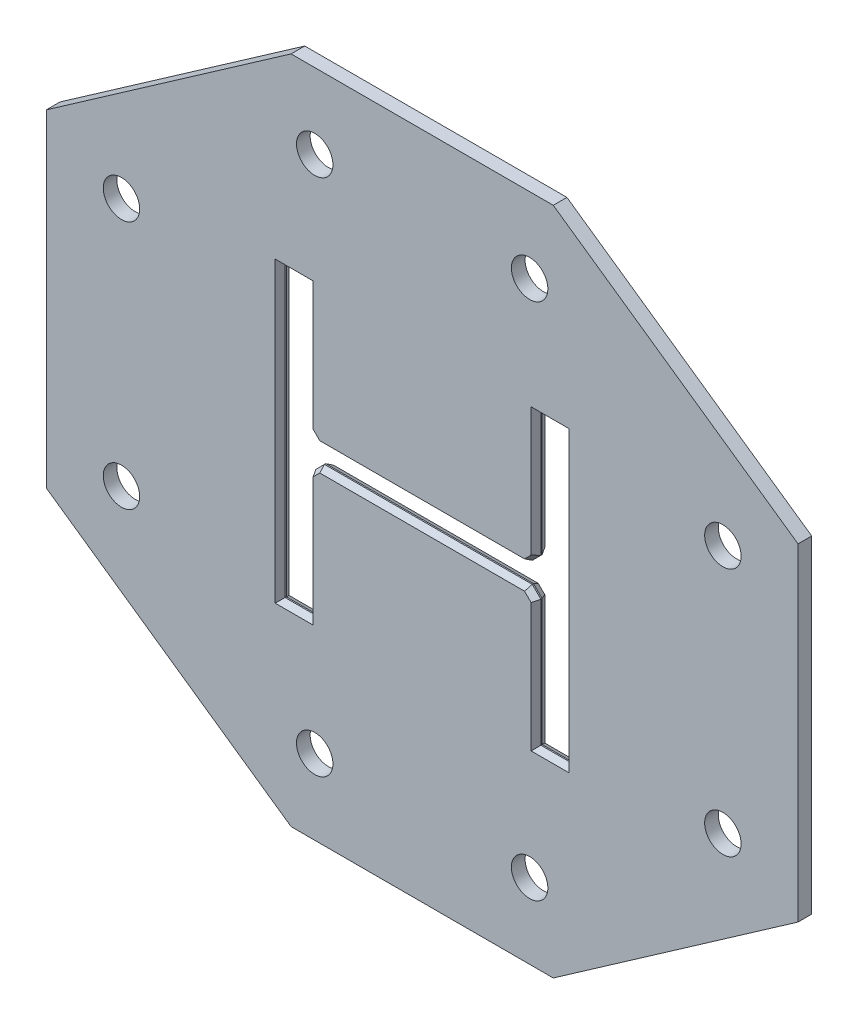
ISO-10303-21;
HEADER;
FILE_DESCRIPTION(('STEP AP214'),'2;1');
FILE_NAME('part.step','',(''),(''),'','','');
FILE_SCHEMA(('AUTOMOTIVE_DESIGN { 1 0 10303 214 1 1 1 1 }'));
ENDSEC;
DATA;
#1=APPLICATION_CONTEXT('core data for automotive mechanical design processes');
#2=APPLICATION_PROTOCOL_DEFINITION('international standard','automotive_design',2000,#1);
#3=PRODUCT_CONTEXT('',#1,'mechanical');
#4=PRODUCT('Part','Part','',(#3));
#5=PRODUCT_RELATED_PRODUCT_CATEGORY('part','',(#4));
#6=PRODUCT_DEFINITION_FORMATION('','',#4);
#7=PRODUCT_DEFINITION_CONTEXT('part definition',#1,'design');
#8=PRODUCT_DEFINITION('design','',#6,#7);
#9=PRODUCT_DEFINITION_SHAPE('','',#8);
#10=(LENGTH_UNIT() NAMED_UNIT(*) SI_UNIT(.MILLI.,.METRE.));
#11=(NAMED_UNIT(*) PLANE_ANGLE_UNIT() SI_UNIT($,.RADIAN.));
#12=(NAMED_UNIT(*) SI_UNIT($,.STERADIAN.) SOLID_ANGLE_UNIT());
#13=UNCERTAINTY_MEASURE_WITH_UNIT(LENGTH_MEASURE(1.E-05),#10,'distance_accuracy_value','');
#14=(GEOMETRIC_REPRESENTATION_CONTEXT(3) GLOBAL_UNCERTAINTY_ASSIGNED_CONTEXT((#13)) GLOBAL_UNIT_ASSIGNED_CONTEXT((#10,
#11,#12)) REPRESENTATION_CONTEXT('',''));
#15=CARTESIAN_POINT('',(0.,0.,0.));
#16=DIRECTION('',(0.,0.,1.));
#17=DIRECTION('',(1.,0.,0.));
#18=AXIS2_PLACEMENT_3D('',#15,#16,#17);
#19=CARTESIAN_POINT('',(156.845,-230.378,9.525));
#20=DIRECTION('',(1.,0.,0.));
#21=DIRECTION('',(0.,0.,-1.));
#22=AXIS2_PLACEMENT_3D('',#19,#20,#21);
#23=PLANE('',#22);
#24=DIRECTION('',(0.,0.,-1.));
#25=VECTOR('',#24,1.);
#26=CARTESIAN_POINT('',(156.845,-202.692,9.525));
#27=LINE('',#26,#25);
#28=CARTESIAN_POINT('',(156.845,-202.692,0.864745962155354));
#29=VERTEX_POINT('',#28);
#30=CARTESIAN_POINT('',(156.845,-202.692,-0.864745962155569));
#31=VERTEX_POINT('',#30);
#32=EDGE_CURVE('E600',#29,#31,#27,.T.);
#33=ORIENTED_EDGE('',*,*,#32,.T.);
#34=DIRECTION('',(0.,1.,0.));
#35=VECTOR('',#34,1.);
#36=CARTESIAN_POINT('',(156.845,-230.378,-0.864745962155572));
#37=LINE('',#36,#35);
#38=CARTESIAN_POINT('',(156.845,-26.5429999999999,-0.864745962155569));
#39=VERTEX_POINT('',#38);
#40=EDGE_CURVE('E60',#31,#39,#37,.T.);
#41=ORIENTED_EDGE('',*,*,#40,.T.);
#42=DIRECTION('',(0.,0.,-1.));
#43=VECTOR('',#42,1.);
#44=CARTESIAN_POINT('',(156.845,-26.5429999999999,9.525));
#45=LINE('',#44,#43);
#46=CARTESIAN_POINT('',(156.845,-26.5429999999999,0.864745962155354));
#47=VERTEX_POINT('',#46);
#48=EDGE_CURVE('E599',#47,#39,#45,.T.);
#49=ORIENTED_EDGE('',*,*,#48,.F.);
#50=DIRECTION('',(0.,-1.,0.));
#51=VECTOR('',#50,1.);
#52=CARTESIAN_POINT('',(156.845,-202.692,0.86474596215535));
#53=LINE('',#52,#51);
#54=EDGE_CURVE('E405',#47,#29,#53,.T.);
#55=ORIENTED_EDGE('',*,*,#54,.T.);
#56=EDGE_LOOP('',(#33,#41,#49,#55));
#57=FACE_BOUND('',#56,.T.);
#58=ADVANCED_FACE('F50',(#57),#23,.T.);
#59=CARTESIAN_POINT('',(-156.845,230.378,9.525));
#60=DIRECTION('',(-1.,0.,0.));
#61=DIRECTION('',(0.,0.,1.));
#62=AXIS2_PLACEMENT_3D('',#59,#60,#61);
#63=PLANE('',#62);
#64=DIRECTION('',(0.,0.,-1.));
#65=VECTOR('',#64,1.);
#66=CARTESIAN_POINT('',(-156.845,202.692,9.525));
#67=LINE('',#66,#65);
#68=CARTESIAN_POINT('',(-156.845,202.692,0.864745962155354));
#69=VERTEX_POINT('',#68);
#70=CARTESIAN_POINT('',(-156.845,202.692,-0.864745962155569));
#71=VERTEX_POINT('',#70);
#72=EDGE_CURVE('E620',#69,#71,#67,.T.);
#73=ORIENTED_EDGE('',*,*,#72,.T.);
#74=DIRECTION('',(0.,-1.,0.));
#75=VECTOR('',#74,1.);
#76=CARTESIAN_POINT('',(-156.845,230.378,-0.864745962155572));
#77=LINE('',#76,#75);
#78=CARTESIAN_POINT('',(-156.845,26.5430000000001,-0.864745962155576));
#79=VERTEX_POINT('',#78);
#80=EDGE_CURVE('E500',#71,#79,#77,.T.);
#81=ORIENTED_EDGE('',*,*,#80,.T.);
#82=DIRECTION('',(0.,0.,-1.));
#83=VECTOR('',#82,1.);
#84=CARTESIAN_POINT('',(-156.845,26.5430000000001,9.525));
#85=LINE('',#84,#83);
#86=CARTESIAN_POINT('',(-156.845,26.5430000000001,0.864745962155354));
#87=VERTEX_POINT('',#86);
#88=EDGE_CURVE('E625',#87,#79,#85,.T.);
#89=ORIENTED_EDGE('',*,*,#88,.F.);
#90=DIRECTION('',(0.,1.,0.));
#91=VECTOR('',#90,1.);
#92=CARTESIAN_POINT('',(-156.845,202.692,0.86474596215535));
#93=LINE('',#92,#91);
#94=EDGE_CURVE('E388',#87,#69,#93,.T.);
#95=ORIENTED_EDGE('',*,*,#94,.T.);
#96=EDGE_LOOP('',(#73,#81,#89,#95));
#97=FACE_BOUND('',#96,.T.);
#98=ADVANCED_FACE('F696',(#97),#63,.T.);
#99=CARTESIAN_POINT('',(0.,0.,9.525));
#100=DIRECTION('',(0.,0.,-1.));
#101=DIRECTION('',(-1.,0.,0.));
#102=AXIS2_PLACEMENT_3D('',#99,#100,#101);
#103=PLANE('',#102);
#104=DIRECTION('',(0.,-1.,0.));
#105=VECTOR('',#104,1.);
#106=CARTESIAN_POINT('',(204.771,-202.692,9.525));
#107=LINE('',#106,#105);
#108=CARTESIAN_POINT('',(204.771,207.692,9.525));
#109=VERTEX_POINT('',#108);
#110=CARTESIAN_POINT('',(204.771,-207.692,9.525));
#111=VERTEX_POINT('',#110);
#112=EDGE_CURVE('E367',#109,#111,#107,.T.);
#113=ORIENTED_EDGE('',*,*,#112,.T.);
#114=DIRECTION('',(-1.,0.,0.));
#115=VECTOR('',#114,1.);
#116=CARTESIAN_POINT('',(156.845,-207.692,9.525));
#117=LINE('',#116,#115);
#118=CARTESIAN_POINT('',(151.845,-207.692,9.525));
#119=VERTEX_POINT('',#118);
#120=EDGE_CURVE('E371',#111,#119,#117,.T.);
#121=ORIENTED_EDGE('',*,*,#120,.T.);
#122=DIRECTION('',(0.,1.,0.));
#123=VECTOR('',#122,1.);
#124=CARTESIAN_POINT('',(151.845,-26.5429999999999,9.525));
#125=LINE('',#124,#123);
#126=CARTESIAN_POINT('',(151.845,-28.6140678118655,9.525));
#127=VERTEX_POINT('',#126);
#128=EDGE_CURVE('E337',#119,#127,#125,.T.);
#129=ORIENTED_EDGE('',*,*,#128,.T.);
#130=DIRECTION('',(-0.707106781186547,0.707106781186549,0.));
#131=VECTOR('',#130,1.);
#132=CARTESIAN_POINT('',(141.244466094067,-18.0135339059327,9.525));
#133=LINE('',#132,#131);
#134=CARTESIAN_POINT('',(142.708932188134,-19.478,9.525));
#135=VERTEX_POINT('',#134);
#136=EDGE_CURVE('E341',#127,#135,#133,.T.);
#137=ORIENTED_EDGE('',*,*,#136,.T.);
#138=DIRECTION('',(-1.,0.,0.));
#139=VECTOR('',#138,1.);
#140=CARTESIAN_POINT('',(-144.78,-19.478,9.525));
#141=LINE('',#140,#139);
#142=CARTESIAN_POINT('',(-142.708932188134,-19.478,9.525));
#143=VERTEX_POINT('',#142);
#144=EDGE_CURVE('E344',#135,#143,#141,.T.);
#145=ORIENTED_EDGE('',*,*,#144,.T.);
#146=DIRECTION('',(-0.707106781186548,-0.707106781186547,0.));
#147=VECTOR('',#146,1.);
#148=CARTESIAN_POINT('',(-153.309466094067,-30.0785339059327,9.525));
#149=LINE('',#148,#147);
#150=CARTESIAN_POINT('',(-151.845,-28.6140678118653,9.525));
#151=VERTEX_POINT('',#150);
#152=EDGE_CURVE('E350',#143,#151,#149,.T.);
#153=ORIENTED_EDGE('',*,*,#152,.T.);
#154=DIRECTION('',(0.,-1.,0.));
#155=VECTOR('',#154,1.);
#156=CARTESIAN_POINT('',(-151.845,-202.692,9.525));
#157=LINE('',#156,#155);
#158=CARTESIAN_POINT('',(-151.845,-207.692,9.525));
#159=VERTEX_POINT('',#158);
#160=EDGE_CURVE('E346',#151,#159,#157,.T.);
#161=ORIENTED_EDGE('',*,*,#160,.T.);
#162=DIRECTION('',(-1.,0.,0.));
#163=VECTOR('',#162,1.);
#164=CARTESIAN_POINT('',(-199.771,-207.692,9.525));
#165=LINE('',#164,#163);
#166=CARTESIAN_POINT('',(-204.771,-207.692,9.525));
#167=VERTEX_POINT('',#166);
#168=EDGE_CURVE('E353',#159,#167,#165,.T.);
#169=ORIENTED_EDGE('',*,*,#168,.T.);
#170=DIRECTION('',(0.,1.,0.));
#171=VECTOR('',#170,1.);
#172=CARTESIAN_POINT('',(-204.771,202.692,9.525));
#173=LINE('',#172,#171);
#174=CARTESIAN_POINT('',(-204.771,207.692,9.525));
#175=VERTEX_POINT('',#174);
#176=EDGE_CURVE('E351',#167,#175,#173,.T.);
#177=ORIENTED_EDGE('',*,*,#176,.T.);
#178=DIRECTION('',(1.,0.,0.));
#179=VECTOR('',#178,1.);
#180=CARTESIAN_POINT('',(-156.845,207.692,9.525));
#181=LINE('',#180,#179);
#182=CARTESIAN_POINT('',(-151.845,207.692,9.525));
#183=VERTEX_POINT('',#182);
#184=EDGE_CURVE('E352',#175,#183,#181,.T.);
#185=ORIENTED_EDGE('',*,*,#184,.T.);
#186=DIRECTION('',(0.,-1.,0.));
#187=VECTOR('',#186,1.);
#188=CARTESIAN_POINT('',(-151.845,26.5430000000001,9.525));
#189=LINE('',#188,#187);
#190=CARTESIAN_POINT('',(-151.845,28.6140678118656,9.525));
#191=VERTEX_POINT('',#190);
#192=EDGE_CURVE('E357',#183,#191,#189,.T.);
#193=ORIENTED_EDGE('',*,*,#192,.T.);
#194=DIRECTION('',(0.707106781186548,-0.707106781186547,0.));
#195=VECTOR('',#194,1.);
#196=CARTESIAN_POINT('',(-141.244466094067,18.013533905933,9.525));
#197=LINE('',#196,#195);
#198=CARTESIAN_POINT('',(-142.708932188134,19.4780000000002,9.525));
#199=VERTEX_POINT('',#198);
#200=EDGE_CURVE('E360',#191,#199,#197,.T.);
#201=ORIENTED_EDGE('',*,*,#200,.T.);
#202=DIRECTION('',(1.,0.,0.));
#203=VECTOR('',#202,1.);
#204=CARTESIAN_POINT('',(144.78,19.4780000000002,9.525));
#205=LINE('',#204,#203);
#206=CARTESIAN_POINT('',(142.708932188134,19.4780000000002,9.525));
#207=VERTEX_POINT('',#206);
#208=EDGE_CURVE('E363',#199,#207,#205,.T.);
#209=ORIENTED_EDGE('',*,*,#208,.T.);
#210=DIRECTION('',(0.707106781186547,0.707106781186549,0.));
#211=VECTOR('',#210,1.);
#212=CARTESIAN_POINT('',(153.309466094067,30.0785339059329,9.525));
#213=LINE('',#212,#211);
#214=CARTESIAN_POINT('',(151.845,28.6140678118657,9.525));
#215=VERTEX_POINT('',#214);
#216=EDGE_CURVE('E361',#207,#215,#213,.T.);
#217=ORIENTED_EDGE('',*,*,#216,.T.);
#218=DIRECTION('',(0.,1.,0.));
#219=VECTOR('',#218,1.);
#220=CARTESIAN_POINT('',(151.845,202.692,9.525));
#221=LINE('',#220,#219);
#222=CARTESIAN_POINT('',(151.845,207.692,9.525));
#223=VERTEX_POINT('',#222);
#224=EDGE_CURVE('E362',#215,#223,#221,.T.);
#225=ORIENTED_EDGE('',*,*,#224,.T.);
#226=DIRECTION('',(1.,0.,0.));
#227=VECTOR('',#226,1.);
#228=CARTESIAN_POINT('',(199.771,207.692,9.525));
#229=LINE('',#228,#227);
#230=EDGE_CURVE('E370',#223,#109,#229,.T.);
#231=ORIENTED_EDGE('',*,*,#230,.T.);
#232=EDGE_LOOP('',(#113,#121,#129,#137,#145,#153,#161,#169,#177,#185,#193,#201,#209,#217,#225,#231));
#233=FACE_BOUND('',#232,.T.);
#234=CARTESIAN_POINT('',(-149.758610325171,-361.549268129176,9.525));
#235=DIRECTION('',(0.,0.,1.));
#236=DIRECTION('',(1.,0.,0.));
#237=AXIS2_PLACEMENT_3D('',#234,#235,#236);
#238=CIRCLE('',#237,25.4);
#239=CARTESIAN_POINT('',(-124.358610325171,-361.549268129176,9.525));
#240=VERTEX_POINT('',#239);
#241=EDGE_CURVE('E1533',#240,#240,#238,.T.);
#242=ORIENTED_EDGE('',*,*,#241,.F.);
#243=EDGE_LOOP('',(#242));
#244=FACE_BOUND('',#243,.T.);
#245=CARTESIAN_POINT('',(149.758610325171,-361.549268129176,9.525));
#246=DIRECTION('',(0.,0.,1.));
#247=DIRECTION('',(1.,0.,0.));
#248=AXIS2_PLACEMENT_3D('',#245,#246,#247);
#249=CIRCLE('',#248,25.4);
#250=CARTESIAN_POINT('',(175.158610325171,-361.549268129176,9.525));
#251=VERTEX_POINT('',#250);
#252=EDGE_CURVE('E1532',#251,#251,#249,.T.);
#253=ORIENTED_EDGE('',*,*,#252,.F.);
#254=EDGE_LOOP('',(#253));
#255=FACE_BOUND('',#254,.T.);
#256=CARTESIAN_POINT('',(419.080268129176,-173.588730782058,9.525));
#257=DIRECTION('',(0.,0.,1.));
#258=DIRECTION('',(1.,0.,0.));
#259=AXIS2_PLACEMENT_3D('',#256,#257,#258);
#260=CIRCLE('',#259,25.4);
#261=CARTESIAN_POINT('',(444.480268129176,-173.588730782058,9.525));
#262=VERTEX_POINT('',#261);
#263=EDGE_CURVE('E1537',#262,#262,#260,.T.);
#264=ORIENTED_EDGE('',*,*,#263,.F.);
#265=EDGE_LOOP('',(#264));
#266=FACE_BOUND('',#265,.T.);
#267=CARTESIAN_POINT('',(419.080268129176,173.588730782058,9.525));
#268=DIRECTION('',(0.,0.,1.));
#269=DIRECTION('',(1.,0.,0.));
#270=AXIS2_PLACEMENT_3D('',#267,#268,#269);
#271=CIRCLE('',#270,25.4);
#272=CARTESIAN_POINT('',(444.480268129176,173.588730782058,9.525));
#273=VERTEX_POINT('',#272);
#274=EDGE_CURVE('E1543',#273,#273,#271,.T.);
#275=ORIENTED_EDGE('',*,*,#274,.F.);
#276=EDGE_LOOP('',(#275));
#277=FACE_BOUND('',#276,.T.);
#278=CARTESIAN_POINT('',(149.758610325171,361.549268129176,9.525));
#279=DIRECTION('',(0.,0.,1.));
#280=DIRECTION('',(1.,0.,0.));
#281=AXIS2_PLACEMENT_3D('',#278,#279,#280);
#282=CIRCLE('',#281,25.4);
#283=CARTESIAN_POINT('',(175.158610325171,361.549268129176,9.525));
#284=VERTEX_POINT('',#283);
#285=EDGE_CURVE('E1550',#284,#284,#282,.T.);
#286=ORIENTED_EDGE('',*,*,#285,.F.);
#287=EDGE_LOOP('',(#286));
#288=FACE_BOUND('',#287,.T.);
#289=CARTESIAN_POINT('',(-149.758610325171,361.549268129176,9.525));
#290=DIRECTION('',(0.,0.,1.));
#291=DIRECTION('',(1.,0.,0.));
#292=AXIS2_PLACEMENT_3D('',#289,#290,#291);
#293=CIRCLE('',#292,25.4);
#294=CARTESIAN_POINT('',(-124.358610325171,361.549268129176,9.525));
#295=VERTEX_POINT('',#294);
#296=EDGE_CURVE('E1552',#295,#295,#293,.T.);
#297=ORIENTED_EDGE('',*,*,#296,.F.);
#298=EDGE_LOOP('',(#297));
#299=FACE_BOUND('',#298,.T.);
#300=CARTESIAN_POINT('',(-419.080268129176,173.588730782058,9.525));
#301=DIRECTION('',(0.,0.,1.));
#302=DIRECTION('',(1.,0.,0.));
#303=AXIS2_PLACEMENT_3D('',#300,#301,#302);
#304=CIRCLE('',#303,25.4);
#305=CARTESIAN_POINT('',(-393.680268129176,173.588730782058,9.525));
#306=VERTEX_POINT('',#305);
#307=EDGE_CURVE('E1553',#306,#306,#304,.T.);
#308=ORIENTED_EDGE('',*,*,#307,.F.);
#309=EDGE_LOOP('',(#308));
#310=FACE_BOUND('',#309,.T.);
#311=CARTESIAN_POINT('',(-419.080268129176,-173.588730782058,9.525));
#312=DIRECTION('',(0.,0.,1.));
#313=DIRECTION('',(1.,0.,0.));
#314=AXIS2_PLACEMENT_3D('',#311,#312,#313);
#315=CIRCLE('',#314,25.4);
#316=CARTESIAN_POINT('',(-393.680268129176,-173.588730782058,9.525));
#317=VERTEX_POINT('',#316);
#318=EDGE_CURVE('E1556',#317,#317,#315,.T.);
#319=ORIENTED_EDGE('',*,*,#318,.F.);
#320=EDGE_LOOP('',(#319));
#321=FACE_BOUND('',#320,.T.);
#322=DIRECTION('',(0.,-1.,0.));
#323=VECTOR('',#322,1.);
#324=CARTESIAN_POINT('',(-523.855268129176,-228.234235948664,9.525));
#325=LINE('',#324,#323);
#326=CARTESIAN_POINT('',(-523.855268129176,228.234235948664,9.525));
#327=VERTEX_POINT('',#326);
#328=CARTESIAN_POINT('',(-523.855268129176,-228.234235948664,9.525));
#329=VERTEX_POINT('',#328);
#330=EDGE_CURVE('E316',#327,#329,#325,.T.);
#331=ORIENTED_EDGE('',*,*,#330,.T.);
#332=DIRECTION('',(0.820038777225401,-0.572307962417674,0.));
#333=VECTOR('',#332,1.);
#334=CARTESIAN_POINT('',(-182.70492307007,-466.324268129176,9.525));
#335=LINE('',#334,#333);
#336=CARTESIAN_POINT('',(-182.70492307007,-466.324268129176,9.525));
#337=VERTEX_POINT('',#336);
#338=EDGE_CURVE('E308',#329,#337,#335,.T.);
#339=ORIENTED_EDGE('',*,*,#338,.T.);
#340=DIRECTION('',(1.,0.,0.));
#341=VECTOR('',#340,1.);
#342=CARTESIAN_POINT('',(182.70492307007,-466.324268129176,9.525));
#343=LINE('',#342,#341);
#344=CARTESIAN_POINT('',(182.70492307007,-466.324268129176,9.525));
#345=VERTEX_POINT('',#344);
#346=EDGE_CURVE('E319',#337,#345,#343,.T.);
#347=ORIENTED_EDGE('',*,*,#346,.T.);
#348=DIRECTION('',(0.820038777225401,0.572307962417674,0.));
#349=VECTOR('',#348,1.);
#350=CARTESIAN_POINT('',(523.855268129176,-228.234235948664,9.525));
#351=LINE('',#350,#349);
#352=CARTESIAN_POINT('',(523.855268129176,-228.234235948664,9.525));
#353=VERTEX_POINT('',#352);
#354=EDGE_CURVE('E626',#345,#353,#351,.T.);
#355=ORIENTED_EDGE('',*,*,#354,.T.);
#356=DIRECTION('',(0.,1.,0.));
#357=VECTOR('',#356,1.);
#358=CARTESIAN_POINT('',(523.855268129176,228.234235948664,9.525));
#359=LINE('',#358,#357);
#360=CARTESIAN_POINT('',(523.855268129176,228.234235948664,9.525));
#361=VERTEX_POINT('',#360);
#362=EDGE_CURVE('E628',#353,#361,#359,.T.);
#363=ORIENTED_EDGE('',*,*,#362,.T.);
#364=DIRECTION('',(-0.820038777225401,0.572307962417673,0.));
#365=VECTOR('',#364,1.);
#366=CARTESIAN_POINT('',(182.70492307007,466.324268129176,9.525));
#367=LINE('',#366,#365);
#368=CARTESIAN_POINT('',(182.70492307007,466.324268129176,9.525));
#369=VERTEX_POINT('',#368);
#370=EDGE_CURVE('E629',#361,#369,#367,.T.);
#371=ORIENTED_EDGE('',*,*,#370,.T.);
#372=DIRECTION('',(-1.,0.,0.));
#373=VECTOR('',#372,1.);
#374=CARTESIAN_POINT('',(-182.704923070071,466.324268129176,9.525));
#375=LINE('',#374,#373);
#376=CARTESIAN_POINT('',(-182.704923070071,466.324268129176,9.525));
#377=VERTEX_POINT('',#376);
#378=EDGE_CURVE('E635',#369,#377,#375,.T.);
#379=ORIENTED_EDGE('',*,*,#378,.T.);
#380=DIRECTION('',(-0.8200387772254,-0.572307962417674,0.));
#381=VECTOR('',#380,1.);
#382=CARTESIAN_POINT('',(-523.855268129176,228.234235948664,9.525));
#383=LINE('',#382,#381);
#384=EDGE_CURVE('E322',#377,#327,#383,.T.);
#385=ORIENTED_EDGE('',*,*,#384,.T.);
#386=EDGE_LOOP('',(#331,#339,#347,#355,#363,#371,#379,#385));
#387=FACE_BOUND('',#386,.T.);
#388=ADVANCED_FACE('F325',(#233,#244,#255,#266,#277,#288,#299,#310,#321,#387),#103,.F.);
#389=CARTESIAN_POINT('',(0.,0.,-9.525));
#390=DIRECTION('',(0.,0.,-1.));
#391=DIRECTION('',(-1.,0.,0.));
#392=AXIS2_PLACEMENT_3D('',#389,#390,#391);
#393=PLANE('',#392);
#394=DIRECTION('',(0.707106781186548,0.707106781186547,0.));
#395=VECTOR('',#394,1.);
#396=CARTESIAN_POINT('',(-61.6154660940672,61.6154660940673,-9.525));
#397=LINE('',#396,#395);
#398=CARTESIAN_POINT('',(-151.845,-28.6140678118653,-9.525));
#399=VERTEX_POINT('',#398);
#400=CARTESIAN_POINT('',(-142.708932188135,-19.4779999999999,-9.525));
#401=VERTEX_POINT('',#400);
#402=EDGE_CURVE('E476',#399,#401,#397,.T.);
#403=ORIENTED_EDGE('',*,*,#402,.T.);
#404=DIRECTION('',(1.,0.,0.));
#405=VECTOR('',#404,1.);
#406=CARTESIAN_POINT('',(0.,-19.4779999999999,-9.525));
#407=LINE('',#406,#405);
#408=CARTESIAN_POINT('',(142.708932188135,-19.4779999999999,-9.525));
#409=VERTEX_POINT('',#408);
#410=EDGE_CURVE('E483',#401,#409,#407,.T.);
#411=ORIENTED_EDGE('',*,*,#410,.T.);
#412=DIRECTION('',(0.707106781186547,-0.707106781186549,0.));
#413=VECTOR('',#412,1.);
#414=CARTESIAN_POINT('',(61.6154660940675,61.6154660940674,-9.525));
#415=LINE('',#414,#413);
#416=CARTESIAN_POINT('',(151.845,-28.6140678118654,-9.525));
#417=VERTEX_POINT('',#416);
#418=EDGE_CURVE('E404',#409,#417,#415,.T.);
#419=ORIENTED_EDGE('',*,*,#418,.T.);
#420=DIRECTION('',(0.,-1.,0.));
#421=VECTOR('',#420,1.);
#422=CARTESIAN_POINT('',(151.845,0.,-9.525));
#423=LINE('',#422,#421);
#424=CARTESIAN_POINT('',(151.845,-207.692,-9.525));
#425=VERTEX_POINT('',#424);
#426=EDGE_CURVE('E451',#417,#425,#423,.T.);
#427=ORIENTED_EDGE('',*,*,#426,.T.);
#428=DIRECTION('',(1.,0.,0.));
#429=VECTOR('',#428,1.);
#430=CARTESIAN_POINT('',(0.,-207.692,-9.525));
#431=LINE('',#430,#429);
#432=CARTESIAN_POINT('',(204.771,-207.692,-9.525));
#433=VERTEX_POINT('',#432);
#434=EDGE_CURVE('E454',#425,#433,#431,.T.);
#435=ORIENTED_EDGE('',*,*,#434,.T.);
#436=DIRECTION('',(0.,1.,0.));
#437=VECTOR('',#436,1.);
#438=CARTESIAN_POINT('',(204.771,0.,-9.525));
#439=LINE('',#438,#437);
#440=CARTESIAN_POINT('',(204.771,207.692,-9.525));
#441=VERTEX_POINT('',#440);
#442=EDGE_CURVE('E460',#433,#441,#439,.T.);
#443=ORIENTED_EDGE('',*,*,#442,.T.);
#444=DIRECTION('',(-1.,0.,0.));
#445=VECTOR('',#444,1.);
#446=CARTESIAN_POINT('',(0.,207.692,-9.525));
#447=LINE('',#446,#445);
#448=CARTESIAN_POINT('',(151.845,207.692,-9.525));
#449=VERTEX_POINT('',#448);
#450=EDGE_CURVE('E456',#441,#449,#447,.T.);
#451=ORIENTED_EDGE('',*,*,#450,.T.);
#452=DIRECTION('',(0.,-1.,0.));
#453=VECTOR('',#452,1.);
#454=CARTESIAN_POINT('',(151.845,0.,-9.525));
#455=LINE('',#454,#453);
#456=CARTESIAN_POINT('',(151.845,28.6140678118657,-9.525));
#457=VERTEX_POINT('',#456);
#458=EDGE_CURVE('E463',#449,#457,#455,.T.);
#459=ORIENTED_EDGE('',*,*,#458,.T.);
#460=DIRECTION('',(-0.707106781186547,-0.707106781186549,0.));
#461=VECTOR('',#460,1.);
#462=CARTESIAN_POINT('',(61.6154660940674,-61.6154660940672,-9.525));
#463=LINE('',#462,#461);
#464=CARTESIAN_POINT('',(142.708932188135,19.4780000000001,-9.525));
#465=VERTEX_POINT('',#464);
#466=EDGE_CURVE('E461',#457,#465,#463,.T.);
#467=ORIENTED_EDGE('',*,*,#466,.T.);
#468=DIRECTION('',(-1.,0.,0.));
#469=VECTOR('',#468,1.);
#470=CARTESIAN_POINT('',(0.,19.4780000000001,-9.525));
#471=LINE('',#470,#469);
#472=CARTESIAN_POINT('',(-142.708932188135,19.4780000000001,-9.525));
#473=VERTEX_POINT('',#472);
#474=EDGE_CURVE('E462',#465,#473,#471,.T.);
#475=ORIENTED_EDGE('',*,*,#474,.T.);
#476=DIRECTION('',(-0.707106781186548,0.707106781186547,0.));
#477=VECTOR('',#476,1.);
#478=CARTESIAN_POINT('',(-61.6154660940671,-61.6154660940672,-9.525));
#479=LINE('',#478,#477);
#480=CARTESIAN_POINT('',(-151.845,28.6140678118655,-9.525));
#481=VERTEX_POINT('',#480);
#482=EDGE_CURVE('E470',#473,#481,#479,.T.);
#483=ORIENTED_EDGE('',*,*,#482,.T.);
#484=DIRECTION('',(0.,1.,0.));
#485=VECTOR('',#484,1.);
#486=CARTESIAN_POINT('',(-151.845,0.,-9.525));
#487=LINE('',#486,#485);
#488=CARTESIAN_POINT('',(-151.845,207.692,-9.525));
#489=VERTEX_POINT('',#488);
#490=EDGE_CURVE('E469',#481,#489,#487,.T.);
#491=ORIENTED_EDGE('',*,*,#490,.T.);
#492=DIRECTION('',(-1.,0.,0.));
#493=VECTOR('',#492,1.);
#494=CARTESIAN_POINT('',(2.6858365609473E-13,207.692,-9.525));
#495=LINE('',#494,#493);
#496=CARTESIAN_POINT('',(-204.771,207.692,-9.525));
#497=VERTEX_POINT('',#496);
#498=EDGE_CURVE('E473',#489,#497,#495,.T.);
#499=ORIENTED_EDGE('',*,*,#498,.T.);
#500=DIRECTION('',(0.,-1.,0.));
#501=VECTOR('',#500,1.);
#502=CARTESIAN_POINT('',(-204.771,0.,-9.525));
#503=LINE('',#502,#501);
#504=CARTESIAN_POINT('',(-204.771,-207.692,-9.525));
#505=VERTEX_POINT('',#504);
#506=EDGE_CURVE('E471',#497,#505,#503,.T.);
#507=ORIENTED_EDGE('',*,*,#506,.T.);
#508=DIRECTION('',(1.,0.,0.));
#509=VECTOR('',#508,1.);
#510=CARTESIAN_POINT('',(0.,-207.692,-9.525));
#511=LINE('',#510,#509);
#512=CARTESIAN_POINT('',(-151.845,-207.692,-9.525));
#513=VERTEX_POINT('',#512);
#514=EDGE_CURVE('E474',#505,#513,#511,.T.);
#515=ORIENTED_EDGE('',*,*,#514,.T.);
#516=DIRECTION('',(0.,1.,0.));
#517=VECTOR('',#516,1.);
#518=CARTESIAN_POINT('',(-151.845,0.,-9.525));
#519=LINE('',#518,#517);
#520=EDGE_CURVE('E480',#513,#399,#519,.T.);
#521=ORIENTED_EDGE('',*,*,#520,.T.);
#522=EDGE_LOOP('',(#403,#411,#419,#427,#435,#443,#451,#459,#467,#475,#483,#491,#499,#507,#515,#521));
#523=FACE_BOUND('',#522,.T.);
#524=CARTESIAN_POINT('',(-149.758610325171,-361.549268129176,-9.525));
#525=DIRECTION('',(0.,0.,1.));
#526=DIRECTION('',(1.,0.,0.));
#527=AXIS2_PLACEMENT_3D('',#524,#525,#526);
#528=CIRCLE('',#527,25.4);
#529=CARTESIAN_POINT('',(-124.358610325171,-361.549268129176,-9.525));
#530=VERTEX_POINT('',#529);
#531=EDGE_CURVE('E453',#530,#530,#528,.T.);
#532=ORIENTED_EDGE('',*,*,#531,.T.);
#533=EDGE_LOOP('',(#532));
#534=FACE_BOUND('',#533,.T.);
#535=CARTESIAN_POINT('',(149.758610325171,-361.549268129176,-9.525));
#536=DIRECTION('',(0.,0.,1.));
#537=DIRECTION('',(1.,0.,0.));
#538=AXIS2_PLACEMENT_3D('',#535,#536,#537);
#539=CIRCLE('',#538,25.4);
#540=CARTESIAN_POINT('',(175.158610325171,-361.549268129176,-9.525));
#541=VERTEX_POINT('',#540);
#542=EDGE_CURVE('E1568',#541,#541,#539,.T.);
#543=ORIENTED_EDGE('',*,*,#542,.T.);
#544=EDGE_LOOP('',(#543));
#545=FACE_BOUND('',#544,.T.);
#546=CARTESIAN_POINT('',(419.080268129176,-173.588730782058,-9.525));
#547=DIRECTION('',(0.,0.,1.));
#548=DIRECTION('',(1.,0.,0.));
#549=AXIS2_PLACEMENT_3D('',#546,#547,#548);
#550=CIRCLE('',#549,25.4);
#551=CARTESIAN_POINT('',(444.480268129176,-173.588730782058,-9.525));
#552=VERTEX_POINT('',#551);
#553=EDGE_CURVE('E1567',#552,#552,#550,.T.);
#554=ORIENTED_EDGE('',*,*,#553,.T.);
#555=EDGE_LOOP('',(#554));
#556=FACE_BOUND('',#555,.T.);
#557=CARTESIAN_POINT('',(419.080268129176,173.588730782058,-9.525));
#558=DIRECTION('',(0.,0.,1.));
#559=DIRECTION('',(1.,0.,0.));
#560=AXIS2_PLACEMENT_3D('',#557,#558,#559);
#561=CIRCLE('',#560,25.4);
#562=CARTESIAN_POINT('',(444.480268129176,173.588730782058,-9.525));
#563=VERTEX_POINT('',#562);
#564=EDGE_CURVE('E1574',#563,#563,#561,.T.);
#565=ORIENTED_EDGE('',*,*,#564,.T.);
#566=EDGE_LOOP('',(#565));
#567=FACE_BOUND('',#566,.T.);
#568=CARTESIAN_POINT('',(149.758610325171,361.549268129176,-9.525));
#569=DIRECTION('',(0.,0.,1.));
#570=DIRECTION('',(1.,0.,0.));
#571=AXIS2_PLACEMENT_3D('',#568,#569,#570);
#572=CIRCLE('',#571,25.4);
#573=CARTESIAN_POINT('',(175.158610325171,361.549268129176,-9.525));
#574=VERTEX_POINT('',#573);
#575=EDGE_CURVE('E1576',#574,#574,#572,.T.);
#576=ORIENTED_EDGE('',*,*,#575,.T.);
#577=EDGE_LOOP('',(#576));
#578=FACE_BOUND('',#577,.T.);
#579=CARTESIAN_POINT('',(-149.758610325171,361.549268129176,-9.525));
#580=DIRECTION('',(0.,0.,1.));
#581=DIRECTION('',(1.,0.,0.));
#582=AXIS2_PLACEMENT_3D('',#579,#580,#581);
#583=CIRCLE('',#582,25.4);
#584=CARTESIAN_POINT('',(-124.358610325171,361.549268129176,-9.525));
#585=VERTEX_POINT('',#584);
#586=EDGE_CURVE('E1585',#585,#585,#583,.T.);
#587=ORIENTED_EDGE('',*,*,#586,.T.);
#588=EDGE_LOOP('',(#587));
#589=FACE_BOUND('',#588,.T.);
#590=CARTESIAN_POINT('',(-419.080268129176,173.588730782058,-9.525));
#591=DIRECTION('',(0.,0.,1.));
#592=DIRECTION('',(1.,0.,0.));
#593=AXIS2_PLACEMENT_3D('',#590,#591,#592);
#594=CIRCLE('',#593,25.4);
#595=CARTESIAN_POINT('',(-393.680268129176,173.588730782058,-9.525));
#596=VERTEX_POINT('',#595);
#597=EDGE_CURVE('E1565',#596,#596,#594,.T.);
#598=ORIENTED_EDGE('',*,*,#597,.T.);
#599=EDGE_LOOP('',(#598));
#600=FACE_BOUND('',#599,.T.);
#601=CARTESIAN_POINT('',(-419.080268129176,-173.588730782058,-9.525));
#602=DIRECTION('',(0.,0.,1.));
#603=DIRECTION('',(1.,0.,0.));
#604=AXIS2_PLACEMENT_3D('',#601,#602,#603);
#605=CIRCLE('',#604,25.4);
#606=CARTESIAN_POINT('',(-393.680268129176,-173.588730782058,-9.525));
#607=VERTEX_POINT('',#606);
#608=EDGE_CURVE('E587',#607,#607,#605,.T.);
#609=ORIENTED_EDGE('',*,*,#608,.T.);
#610=EDGE_LOOP('',(#609));
#611=FACE_BOUND('',#610,.T.);
#612=DIRECTION('',(0.,-1.,0.));
#613=VECTOR('',#612,1.);
#614=CARTESIAN_POINT('',(-523.855268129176,-228.234235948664,-9.525));
#615=LINE('',#614,#613);
#616=CARTESIAN_POINT('',(-523.855268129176,228.234235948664,-9.525));
#617=VERTEX_POINT('',#616);
#618=CARTESIAN_POINT('',(-523.855268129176,-228.234235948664,-9.525));
#619=VERTEX_POINT('',#618);
#620=EDGE_CURVE('E335',#617,#619,#615,.T.);
#621=ORIENTED_EDGE('',*,*,#620,.F.);
#622=DIRECTION('',(-0.8200387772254,-0.572307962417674,0.));
#623=VECTOR('',#622,1.);
#624=CARTESIAN_POINT('',(-523.855268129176,228.234235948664,-9.525));
#625=LINE('',#624,#623);
#626=CARTESIAN_POINT('',(-182.704923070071,466.324268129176,-9.525));
#627=VERTEX_POINT('',#626);
#628=EDGE_CURVE('E329',#627,#617,#625,.T.);
#629=ORIENTED_EDGE('',*,*,#628,.F.);
#630=DIRECTION('',(-1.,0.,0.));
#631=VECTOR('',#630,1.);
#632=CARTESIAN_POINT('',(-182.704923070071,466.324268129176,-9.525));
#633=LINE('',#632,#631);
#634=CARTESIAN_POINT('',(182.70492307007,466.324268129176,-9.525));
#635=VERTEX_POINT('',#634);
#636=EDGE_CURVE('E650',#635,#627,#633,.T.);
#637=ORIENTED_EDGE('',*,*,#636,.F.);
#638=DIRECTION('',(-0.820038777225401,0.572307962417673,0.));
#639=VECTOR('',#638,1.);
#640=CARTESIAN_POINT('',(182.70492307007,466.324268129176,-9.525));
#641=LINE('',#640,#639);
#642=CARTESIAN_POINT('',(523.855268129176,228.234235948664,-9.525));
#643=VERTEX_POINT('',#642);
#644=EDGE_CURVE('E643',#643,#635,#641,.T.);
#645=ORIENTED_EDGE('',*,*,#644,.F.);
#646=DIRECTION('',(0.,1.,0.));
#647=VECTOR('',#646,1.);
#648=CARTESIAN_POINT('',(523.855268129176,228.234235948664,-9.525));
#649=LINE('',#648,#647);
#650=CARTESIAN_POINT('',(523.855268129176,-228.234235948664,-9.525));
#651=VERTEX_POINT('',#650);
#652=EDGE_CURVE('E644',#651,#643,#649,.T.);
#653=ORIENTED_EDGE('',*,*,#652,.F.);
#654=DIRECTION('',(0.820038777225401,0.572307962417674,0.));
#655=VECTOR('',#654,1.);
#656=CARTESIAN_POINT('',(523.855268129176,-228.234235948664,-9.525));
#657=LINE('',#656,#655);
#658=CARTESIAN_POINT('',(182.70492307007,-466.324268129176,-9.525));
#659=VERTEX_POINT('',#658);
#660=EDGE_CURVE('E642',#659,#651,#657,.T.);
#661=ORIENTED_EDGE('',*,*,#660,.F.);
#662=DIRECTION('',(1.,0.,0.));
#663=VECTOR('',#662,1.);
#664=CARTESIAN_POINT('',(182.70492307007,-466.324268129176,-9.525));
#665=LINE('',#664,#663);
#666=CARTESIAN_POINT('',(-182.70492307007,-466.324268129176,-9.525));
#667=VERTEX_POINT('',#666);
#668=EDGE_CURVE('E638',#667,#659,#665,.T.);
#669=ORIENTED_EDGE('',*,*,#668,.F.);
#670=DIRECTION('',(0.820038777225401,-0.572307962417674,0.));
#671=VECTOR('',#670,1.);
#672=CARTESIAN_POINT('',(-182.70492307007,-466.324268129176,-9.525));
#673=LINE('',#672,#671);
#674=EDGE_CURVE('E640',#619,#667,#673,.T.);
#675=ORIENTED_EDGE('',*,*,#674,.F.);
#676=EDGE_LOOP('',(#621,#629,#637,#645,#653,#661,#669,#675));
#677=FACE_BOUND('',#676,.T.);
#678=ADVANCED_FACE('F674',(#523,#534,#545,#556,#567,#578,#589,#600,#611,#677),#393,.T.);
#679=CARTESIAN_POINT('',(-523.855268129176,-228.234235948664,9.525));
#680=DIRECTION('',(1.,0.,0.));
#681=DIRECTION('',(0.,0.,-1.));
#682=AXIS2_PLACEMENT_3D('',#679,#680,#681);
#683=PLANE('',#682);
#684=ORIENTED_EDGE('',*,*,#620,.T.);
#685=DIRECTION('',(0.,0.,-1.));
#686=VECTOR('',#685,1.);
#687=CARTESIAN_POINT('',(-523.855268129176,-228.234235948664,9.525));
#688=LINE('',#687,#686);
#689=EDGE_CURVE('E315',#329,#619,#688,.T.);
#690=ORIENTED_EDGE('',*,*,#689,.F.);
#691=ORIENTED_EDGE('',*,*,#330,.F.);
#692=DIRECTION('',(0.,0.,-1.));
#693=VECTOR('',#692,1.);
#694=CARTESIAN_POINT('',(-523.855268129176,228.234235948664,9.525));
#695=LINE('',#694,#693);
#696=EDGE_CURVE('E634',#327,#617,#695,.T.);
#697=ORIENTED_EDGE('',*,*,#696,.T.);
#698=EDGE_LOOP('',(#684,#690,#691,#697));
#699=FACE_BOUND('',#698,.T.);
#700=ADVANCED_FACE('F328',(#699),#683,.F.);
#701=CARTESIAN_POINT('',(-182.70492307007,-466.324268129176,9.525));
#702=DIRECTION('',(0.572307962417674,0.820038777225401,0.));
#703=DIRECTION('',(-0.820038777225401,0.572307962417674,0.));
#704=AXIS2_PLACEMENT_3D('',#701,#702,#703);
#705=PLANE('',#704);
#706=ORIENTED_EDGE('',*,*,#674,.T.);
#707=DIRECTION('',(0.,0.,-1.));
#708=VECTOR('',#707,1.);
#709=CARTESIAN_POINT('',(-182.70492307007,-466.324268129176,9.525));
#710=LINE('',#709,#708);
#711=EDGE_CURVE('E314',#337,#667,#710,.T.);
#712=ORIENTED_EDGE('',*,*,#711,.F.);
#713=ORIENTED_EDGE('',*,*,#338,.F.);
#714=ORIENTED_EDGE('',*,*,#689,.T.);
#715=EDGE_LOOP('',(#706,#712,#713,#714));
#716=FACE_BOUND('',#715,.T.);
#717=ADVANCED_FACE('F309',(#716),#705,.F.);
#718=CARTESIAN_POINT('',(182.70492307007,-466.324268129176,9.525));
#719=DIRECTION('',(0.,1.,0.));
#720=DIRECTION('',(0.,0.,1.));
#721=AXIS2_PLACEMENT_3D('',#718,#719,#720);
#722=PLANE('',#721);
#723=ORIENTED_EDGE('',*,*,#668,.T.);
#724=DIRECTION('',(0.,0.,-1.));
#725=VECTOR('',#724,1.);
#726=CARTESIAN_POINT('',(182.70492307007,-466.324268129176,9.525));
#727=LINE('',#726,#725);
#728=EDGE_CURVE('E336',#345,#659,#727,.T.);
#729=ORIENTED_EDGE('',*,*,#728,.F.);
#730=ORIENTED_EDGE('',*,*,#346,.F.);
#731=ORIENTED_EDGE('',*,*,#711,.T.);
#732=EDGE_LOOP('',(#723,#729,#730,#731));
#733=FACE_BOUND('',#732,.T.);
#734=ADVANCED_FACE('F688',(#733),#722,.F.);
#735=CARTESIAN_POINT('',(523.855268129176,-228.234235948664,9.525));
#736=DIRECTION('',(-0.572307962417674,0.820038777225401,0.));
#737=DIRECTION('',(-0.820038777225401,-0.572307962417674,0.));
#738=AXIS2_PLACEMENT_3D('',#735,#736,#737);
#739=PLANE('',#738);
#740=ORIENTED_EDGE('',*,*,#660,.T.);
#741=DIRECTION('',(0.,0.,-1.));
#742=VECTOR('',#741,1.);
#743=CARTESIAN_POINT('',(523.855268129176,-228.234235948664,9.525));
#744=LINE('',#743,#742);
#745=EDGE_CURVE('E657',#353,#651,#744,.T.);
#746=ORIENTED_EDGE('',*,*,#745,.F.);
#747=ORIENTED_EDGE('',*,*,#354,.F.);
#748=ORIENTED_EDGE('',*,*,#728,.T.);
#749=EDGE_LOOP('',(#740,#746,#747,#748));
#750=FACE_BOUND('',#749,.T.);
#751=ADVANCED_FACE('F670',(#750),#739,.F.);
#752=CARTESIAN_POINT('',(523.855268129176,228.234235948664,9.525));
#753=DIRECTION('',(-1.,0.,0.));
#754=DIRECTION('',(0.,-1.,0.));
#755=AXIS2_PLACEMENT_3D('',#752,#753,#754);
#756=PLANE('',#755);
#757=ORIENTED_EDGE('',*,*,#652,.T.);
#758=DIRECTION('',(0.,0.,-1.));
#759=VECTOR('',#758,1.);
#760=CARTESIAN_POINT('',(523.855268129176,228.234235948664,9.525));
#761=LINE('',#760,#759);
#762=EDGE_CURVE('E660',#361,#643,#761,.T.);
#763=ORIENTED_EDGE('',*,*,#762,.F.);
#764=ORIENTED_EDGE('',*,*,#362,.F.);
#765=ORIENTED_EDGE('',*,*,#745,.T.);
#766=EDGE_LOOP('',(#757,#763,#764,#765));
#767=FACE_BOUND('',#766,.T.);
#768=ADVANCED_FACE('F676',(#767),#756,.F.);
#769=CARTESIAN_POINT('',(182.70492307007,466.324268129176,9.525));
#770=DIRECTION('',(-0.572307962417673,-0.820038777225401,0.));
#771=DIRECTION('',(0.820038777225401,-0.572307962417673,0.));
#772=AXIS2_PLACEMENT_3D('',#769,#770,#771);
#773=PLANE('',#772);
#774=ORIENTED_EDGE('',*,*,#644,.T.);
#775=DIRECTION('',(0.,0.,-1.));
#776=VECTOR('',#775,1.);
#777=CARTESIAN_POINT('',(182.70492307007,466.324268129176,9.525));
#778=LINE('',#777,#776);
#779=EDGE_CURVE('E651',#369,#635,#778,.T.);
#780=ORIENTED_EDGE('',*,*,#779,.F.);
#781=ORIENTED_EDGE('',*,*,#370,.F.);
#782=ORIENTED_EDGE('',*,*,#762,.T.);
#783=EDGE_LOOP('',(#774,#780,#781,#782));
#784=FACE_BOUND('',#783,.T.);
#785=ADVANCED_FACE('F682',(#784),#773,.F.);
#786=CARTESIAN_POINT('',(-182.704923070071,466.324268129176,9.525));
#787=DIRECTION('',(0.,-1.,0.));
#788=DIRECTION('',(1.,0.,0.));
#789=AXIS2_PLACEMENT_3D('',#786,#787,#788);
#790=PLANE('',#789);
#791=ORIENTED_EDGE('',*,*,#636,.T.);
#792=DIRECTION('',(0.,0.,-1.));
#793=VECTOR('',#792,1.);
#794=CARTESIAN_POINT('',(-182.704923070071,466.324268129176,9.525));
#795=LINE('',#794,#793);
#796=EDGE_CURVE('E652',#377,#627,#795,.T.);
#797=ORIENTED_EDGE('',*,*,#796,.F.);
#798=ORIENTED_EDGE('',*,*,#378,.F.);
#799=ORIENTED_EDGE('',*,*,#779,.T.);
#800=EDGE_LOOP('',(#791,#797,#798,#799));
#801=FACE_BOUND('',#800,.T.);
#802=ADVANCED_FACE('F717',(#801),#790,.F.);
#803=CARTESIAN_POINT('',(-523.855268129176,228.234235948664,9.525));
#804=DIRECTION('',(0.572307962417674,-0.8200387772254,0.));
#805=DIRECTION('',(0.820038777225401,0.572307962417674,0.));
#806=AXIS2_PLACEMENT_3D('',#803,#804,#805);
#807=PLANE('',#806);
#808=ORIENTED_EDGE('',*,*,#628,.T.);
#809=ORIENTED_EDGE('',*,*,#696,.F.);
#810=ORIENTED_EDGE('',*,*,#384,.F.);
#811=ORIENTED_EDGE('',*,*,#796,.T.);
#812=EDGE_LOOP('',(#808,#809,#810,#811));
#813=FACE_BOUND('',#812,.T.);
#814=ADVANCED_FACE('F711',(#813),#807,.F.);
#815=CARTESIAN_POINT('',(156.845,54.2290000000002,9.525));
#816=DIRECTION('',(1.,0.,0.));
#817=DIRECTION('',(0.,0.,-1.));
#818=AXIS2_PLACEMENT_3D('',#815,#816,#817);
#819=PLANE('',#818);
#820=DIRECTION('',(0.,0.,-1.));
#821=VECTOR('',#820,1.);
#822=CARTESIAN_POINT('',(156.845,26.5430000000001,9.525));
#823=LINE('',#822,#821);
#824=CARTESIAN_POINT('',(156.845,26.5430000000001,0.864745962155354));
#825=VERTEX_POINT('',#824);
#826=CARTESIAN_POINT('',(156.845,26.5430000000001,-0.864745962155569));
#827=VERTEX_POINT('',#826);
#828=EDGE_CURVE('E585',#825,#827,#823,.T.);
#829=ORIENTED_EDGE('',*,*,#828,.T.);
#830=DIRECTION('',(0.,1.,0.));
#831=VECTOR('',#830,1.);
#832=CARTESIAN_POINT('',(156.845,54.2290000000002,-0.864745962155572));
#833=LINE('',#832,#831);
#834=CARTESIAN_POINT('',(156.845,202.692,-0.864745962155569));
#835=VERTEX_POINT('',#834);
#836=EDGE_CURVE('E504',#827,#835,#833,.T.);
#837=ORIENTED_EDGE('',*,*,#836,.T.);
#838=DIRECTION('',(0.,0.,-1.));
#839=VECTOR('',#838,1.);
#840=CARTESIAN_POINT('',(156.845,202.692,9.525));
#841=LINE('',#840,#839);
#842=CARTESIAN_POINT('',(156.845,202.692,0.864745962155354));
#843=VERTEX_POINT('',#842);
#844=EDGE_CURVE('E582',#843,#835,#841,.T.);
#845=ORIENTED_EDGE('',*,*,#844,.F.);
#846=DIRECTION('',(0.,-1.,0.));
#847=VECTOR('',#846,1.);
#848=CARTESIAN_POINT('',(156.845,26.5430000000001,0.86474596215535));
#849=LINE('',#848,#847);
#850=EDGE_CURVE('E377',#843,#825,#849,.T.);
#851=ORIENTED_EDGE('',*,*,#850,.T.);
#852=EDGE_LOOP('',(#829,#837,#845,#851));
#853=FACE_BOUND('',#852,.T.);
#854=ADVANCED_FACE('F707',(#853),#819,.T.);
#855=CARTESIAN_POINT('',(-156.845,-54.2289999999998,9.525));
#856=DIRECTION('',(-1.,0.,0.));
#857=DIRECTION('',(0.,0.,1.));
#858=AXIS2_PLACEMENT_3D('',#855,#856,#857);
#859=PLANE('',#858);
#860=DIRECTION('',(0.,0.,-1.));
#861=VECTOR('',#860,1.);
#862=CARTESIAN_POINT('',(-156.845,-26.5429999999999,9.525));
#863=LINE('',#862,#861);
#864=CARTESIAN_POINT('',(-156.845,-26.5429999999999,0.864745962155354));
#865=VERTEX_POINT('',#864);
#866=CARTESIAN_POINT('',(-156.845,-26.5429999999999,-0.864745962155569));
#867=VERTEX_POINT('',#866);
#868=EDGE_CURVE('E610',#865,#867,#863,.T.);
#869=ORIENTED_EDGE('',*,*,#868,.T.);
#870=DIRECTION('',(0.,-1.,0.));
#871=VECTOR('',#870,1.);
#872=CARTESIAN_POINT('',(-156.845,-54.2289999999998,-0.864745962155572));
#873=LINE('',#872,#871);
#874=CARTESIAN_POINT('',(-156.845,-202.692,-0.864745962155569));
#875=VERTEX_POINT('',#874);
#876=EDGE_CURVE('E490',#867,#875,#873,.T.);
#877=ORIENTED_EDGE('',*,*,#876,.T.);
#878=DIRECTION('',(0.,0.,-1.));
#879=VECTOR('',#878,1.);
#880=CARTESIAN_POINT('',(-156.845,-202.692,9.525));
#881=LINE('',#880,#879);
#882=CARTESIAN_POINT('',(-156.845,-202.692,0.864745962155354));
#883=VERTEX_POINT('',#882);
#884=EDGE_CURVE('E608',#883,#875,#881,.T.);
#885=ORIENTED_EDGE('',*,*,#884,.F.);
#886=DIRECTION('',(0.,1.,0.));
#887=VECTOR('',#886,1.);
#888=CARTESIAN_POINT('',(-156.845,-26.5429999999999,0.86474596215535));
#889=LINE('',#888,#887);
#890=EDGE_CURVE('E391',#883,#865,#889,.T.);
#891=ORIENTED_EDGE('',*,*,#890,.T.);
#892=EDGE_LOOP('',(#869,#877,#885,#891));
#893=FACE_BOUND('',#892,.T.);
#894=ADVANCED_FACE('F1253',(#893),#859,.T.);
#895=CARTESIAN_POINT('',(156.845,-26.5429999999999,9.525));
#896=DIRECTION('',(0.707106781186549,0.707106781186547,0.));
#897=DIRECTION('',(-0.707106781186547,0.707106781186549,0.));
#898=AXIS2_PLACEMENT_3D('',#895,#896,#897);
#899=PLANE('',#898);
#900=ORIENTED_EDGE('',*,*,#48,.T.);
#901=DIRECTION('',(-0.707106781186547,0.707106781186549,0.));
#902=VECTOR('',#901,1.);
#903=CARTESIAN_POINT('',(156.845,-26.5429999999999,-0.864745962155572));
#904=LINE('',#903,#902);
#905=CARTESIAN_POINT('',(144.78,-14.4779999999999,-0.864745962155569));
#906=VERTEX_POINT('',#905);
#907=EDGE_CURVE('E11',#39,#906,#904,.T.);
#908=ORIENTED_EDGE('',*,*,#907,.T.);
#909=DIRECTION('',(0.,0.,-1.));
#910=VECTOR('',#909,1.);
#911=CARTESIAN_POINT('',(144.78,-14.4779999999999,9.525));
#912=LINE('',#911,#910);
#913=CARTESIAN_POINT('',(144.78,-14.4779999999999,0.864745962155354));
#914=VERTEX_POINT('',#913);
#915=EDGE_CURVE('E603',#914,#906,#912,.T.);
#916=ORIENTED_EDGE('',*,*,#915,.F.);
#917=DIRECTION('',(0.707106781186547,-0.707106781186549,0.));
#918=VECTOR('',#917,1.);
#919=CARTESIAN_POINT('',(156.845,-26.5429999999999,0.86474596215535));
#920=LINE('',#919,#918);
#921=EDGE_CURVE('E397',#914,#47,#920,.T.);
#922=ORIENTED_EDGE('',*,*,#921,.T.);
#923=EDGE_LOOP('',(#900,#908,#916,#922));
#924=FACE_BOUND('',#923,.T.);
#925=ADVANCED_FACE('F1258',(#924),#899,.T.);
#926=CARTESIAN_POINT('',(144.78,-14.4779999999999,9.525));
#927=DIRECTION('',(0.,1.,0.));
#928=DIRECTION('',(0.,0.,1.));
#929=AXIS2_PLACEMENT_3D('',#926,#927,#928);
#930=PLANE('',#929);
#931=ORIENTED_EDGE('',*,*,#915,.T.);
#932=DIRECTION('',(-1.,0.,0.));
#933=VECTOR('',#932,1.);
#934=CARTESIAN_POINT('',(144.78,-14.4779999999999,-0.864745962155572));
#935=LINE('',#934,#933);
#936=CARTESIAN_POINT('',(-144.78,-14.4779999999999,-0.864745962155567));
#937=VERTEX_POINT('',#936);
#938=EDGE_CURVE('E484',#906,#937,#935,.T.);
#939=ORIENTED_EDGE('',*,*,#938,.T.);
#940=DIRECTION('',(0.,0.,-1.));
#941=VECTOR('',#940,1.);
#942=CARTESIAN_POINT('',(-144.78,-14.4779999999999,9.525));
#943=LINE('',#942,#941);
#944=CARTESIAN_POINT('',(-144.78,-14.4779999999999,0.864745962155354));
#945=VERTEX_POINT('',#944);
#946=EDGE_CURVE('E602',#945,#937,#943,.T.);
#947=ORIENTED_EDGE('',*,*,#946,.F.);
#948=DIRECTION('',(1.,0.,0.));
#949=VECTOR('',#948,1.);
#950=CARTESIAN_POINT('',(144.78,-14.4779999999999,0.86474596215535));
#951=LINE('',#950,#949);
#952=EDGE_CURVE('E396',#945,#914,#951,.T.);
#953=ORIENTED_EDGE('',*,*,#952,.T.);
#954=EDGE_LOOP('',(#931,#939,#947,#953));
#955=FACE_BOUND('',#954,.T.);
#956=ADVANCED_FACE('F1282',(#955),#930,.T.);
#957=CARTESIAN_POINT('',(-144.78,-14.4779999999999,9.525));
#958=DIRECTION('',(-0.707106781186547,0.707106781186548,0.));
#959=DIRECTION('',(-0.707106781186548,-0.707106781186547,0.));
#960=AXIS2_PLACEMENT_3D('',#957,#958,#959);
#961=PLANE('',#960);
#962=ORIENTED_EDGE('',*,*,#946,.T.);
#963=DIRECTION('',(-0.707106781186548,-0.707106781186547,0.));
#964=VECTOR('',#963,1.);
#965=CARTESIAN_POINT('',(-144.78,-14.4779999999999,-0.864745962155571));
#966=LINE('',#965,#964);
#967=EDGE_CURVE('E487',#937,#867,#966,.T.);
#968=ORIENTED_EDGE('',*,*,#967,.T.);
#969=ORIENTED_EDGE('',*,*,#868,.F.);
#970=DIRECTION('',(0.707106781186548,0.707106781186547,0.));
#971=VECTOR('',#970,1.);
#972=CARTESIAN_POINT('',(-144.78,-14.4779999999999,0.86474596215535));
#973=LINE('',#972,#971);
#974=EDGE_CURVE('E398',#865,#945,#973,.T.);
#975=ORIENTED_EDGE('',*,*,#974,.T.);
#976=EDGE_LOOP('',(#962,#968,#969,#975));
#977=FACE_BOUND('',#976,.T.);
#978=ADVANCED_FACE('F1294',(#977),#961,.T.);
#979=CARTESIAN_POINT('',(-199.771,-202.692,9.525));
#980=DIRECTION('',(1.,0.,0.));
#981=DIRECTION('',(0.,0.,-1.));
#982=AXIS2_PLACEMENT_3D('',#979,#980,#981);
#983=PLANE('',#982);
#984=DIRECTION('',(0.,0.,-1.));
#985=VECTOR('',#984,1.);
#986=CARTESIAN_POINT('',(-199.771,-202.692,9.525));
#987=LINE('',#986,#985);
#988=CARTESIAN_POINT('',(-199.771,-202.692,0.864745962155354));
#989=VERTEX_POINT('',#988);
#990=CARTESIAN_POINT('',(-199.771,-202.692,-0.864745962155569));
#991=VERTEX_POINT('',#990);
#992=EDGE_CURVE('E611',#989,#991,#987,.T.);
#993=ORIENTED_EDGE('',*,*,#992,.T.);
#994=DIRECTION('',(0.,1.,0.));
#995=VECTOR('',#994,1.);
#996=CARTESIAN_POINT('',(-199.771,-202.692,-0.864745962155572));
#997=LINE('',#996,#995);
#998=CARTESIAN_POINT('',(-199.771,202.692,-0.864745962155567));
#999=VERTEX_POINT('',#998);
#1000=EDGE_CURVE('E491',#991,#999,#997,.T.);
#1001=ORIENTED_EDGE('',*,*,#1000,.T.);
#1002=DIRECTION('',(0.,0.,-1.));
#1003=VECTOR('',#1002,1.);
#1004=CARTESIAN_POINT('',(-199.771,202.692,9.525));
#1005=LINE('',#1004,#1003);
#1006=CARTESIAN_POINT('',(-199.771,202.692,0.864745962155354));
#1007=VERTEX_POINT('',#1006);
#1008=EDGE_CURVE('E618',#1007,#999,#1005,.T.);
#1009=ORIENTED_EDGE('',*,*,#1008,.F.);
#1010=DIRECTION('',(0.,-1.,0.));
#1011=VECTOR('',#1010,1.);
#1012=CARTESIAN_POINT('',(-199.771,-202.692,0.86474596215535));
#1013=LINE('',#1012,#1011);
#1014=EDGE_CURVE('E389',#1007,#989,#1013,.T.);
#1015=ORIENTED_EDGE('',*,*,#1014,.T.);
#1016=EDGE_LOOP('',(#993,#1001,#1009,#1015));
#1017=FACE_BOUND('',#1016,.T.);
#1018=ADVANCED_FACE('F1305',(#1017),#983,.T.);
#1019=CARTESIAN_POINT('',(-156.845,-202.692,9.525));
#1020=DIRECTION('',(0.,1.,0.));
#1021=DIRECTION('',(0.,0.,1.));
#1022=AXIS2_PLACEMENT_3D('',#1019,#1020,#1021);
#1023=PLANE('',#1022);
#1024=ORIENTED_EDGE('',*,*,#884,.T.);
#1025=DIRECTION('',(-1.,0.,0.));
#1026=VECTOR('',#1025,1.);
#1027=CARTESIAN_POINT('',(-156.845,-202.692,-0.864745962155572));
#1028=LINE('',#1027,#1026);
#1029=EDGE_CURVE('E493',#875,#991,#1028,.T.);
#1030=ORIENTED_EDGE('',*,*,#1029,.T.);
#1031=ORIENTED_EDGE('',*,*,#992,.F.);
#1032=DIRECTION('',(1.,0.,0.));
#1033=VECTOR('',#1032,1.);
#1034=CARTESIAN_POINT('',(-156.845,-202.692,0.86474596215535));
#1035=LINE('',#1034,#1033);
#1036=EDGE_CURVE('E395',#989,#883,#1035,.T.);
#1037=ORIENTED_EDGE('',*,*,#1036,.T.);
#1038=EDGE_LOOP('',(#1024,#1030,#1031,#1037));
#1039=FACE_BOUND('',#1038,.T.);
#1040=ADVANCED_FACE('F1312',(#1039),#1023,.T.);
#1041=CARTESIAN_POINT('',(-199.771,202.692,9.525));
#1042=DIRECTION('',(0.,-1.,0.));
#1043=DIRECTION('',(1.,0.,0.));
#1044=AXIS2_PLACEMENT_3D('',#1041,#1042,#1043);
#1045=PLANE('',#1044);
#1046=ORIENTED_EDGE('',*,*,#1008,.T.);
#1047=DIRECTION('',(1.,0.,0.));
#1048=VECTOR('',#1047,1.);
#1049=CARTESIAN_POINT('',(-199.771,202.692,-0.864745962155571));
#1050=LINE('',#1049,#1048);
#1051=EDGE_CURVE('E492',#999,#71,#1050,.T.);
#1052=ORIENTED_EDGE('',*,*,#1051,.T.);
#1053=ORIENTED_EDGE('',*,*,#72,.F.);
#1054=DIRECTION('',(-1.,0.,0.));
#1055=VECTOR('',#1054,1.);
#1056=CARTESIAN_POINT('',(-199.771,202.692,0.86474596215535));
#1057=LINE('',#1056,#1055);
#1058=EDGE_CURVE('E386',#69,#1007,#1057,.T.);
#1059=ORIENTED_EDGE('',*,*,#1058,.T.);
#1060=EDGE_LOOP('',(#1046,#1052,#1053,#1059));
#1061=FACE_BOUND('',#1060,.T.);
#1062=ADVANCED_FACE('F1319',(#1061),#1045,.T.);
#1063=CARTESIAN_POINT('',(-144.78,14.4780000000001,9.525));
#1064=DIRECTION('',(-0.707106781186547,-0.707106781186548,0.));
#1065=DIRECTION('',(0.707106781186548,-0.707106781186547,0.));
#1066=AXIS2_PLACEMENT_3D('',#1063,#1064,#1065);
#1067=PLANE('',#1066);
#1068=ORIENTED_EDGE('',*,*,#88,.T.);
#1069=DIRECTION('',(0.707106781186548,-0.707106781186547,0.));
#1070=VECTOR('',#1069,1.);
#1071=CARTESIAN_POINT('',(-144.78,14.4780000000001,-0.864745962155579));
#1072=LINE('',#1071,#1070);
#1073=CARTESIAN_POINT('',(-144.78,14.4780000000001,-0.864745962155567));
#1074=VERTEX_POINT('',#1073);
#1075=EDGE_CURVE('E497',#79,#1074,#1072,.T.);
#1076=ORIENTED_EDGE('',*,*,#1075,.T.);
#1077=DIRECTION('',(0.,0.,-1.));
#1078=VECTOR('',#1077,1.);
#1079=CARTESIAN_POINT('',(-144.78,14.4780000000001,9.525));
#1080=LINE('',#1079,#1078);
#1081=CARTESIAN_POINT('',(-144.78,14.4780000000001,0.864745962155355));
#1082=VERTEX_POINT('',#1081);
#1083=EDGE_CURVE('E577',#1082,#1074,#1080,.T.);
#1084=ORIENTED_EDGE('',*,*,#1083,.F.);
#1085=DIRECTION('',(-0.707106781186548,0.707106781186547,0.));
#1086=VECTOR('',#1085,1.);
#1087=CARTESIAN_POINT('',(-156.845,26.5430000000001,0.864745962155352));
#1088=LINE('',#1087,#1086);
#1089=EDGE_CURVE('E381',#1082,#87,#1088,.T.);
#1090=ORIENTED_EDGE('',*,*,#1089,.T.);
#1091=EDGE_LOOP('',(#1068,#1076,#1084,#1090));
#1092=FACE_BOUND('',#1091,.T.);
#1093=ADVANCED_FACE('F1329',(#1092),#1067,.T.);
#1094=CARTESIAN_POINT('',(-144.78,14.4780000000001,9.525));
#1095=DIRECTION('',(0.,-1.,0.));
#1096=DIRECTION('',(1.,0.,0.));
#1097=AXIS2_PLACEMENT_3D('',#1094,#1095,#1096);
#1098=PLANE('',#1097);
#1099=ORIENTED_EDGE('',*,*,#1083,.T.);
#1100=DIRECTION('',(1.,0.,0.));
#1101=VECTOR('',#1100,1.);
#1102=CARTESIAN_POINT('',(-144.78,14.4780000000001,-0.864745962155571));
#1103=LINE('',#1102,#1101);
#1104=CARTESIAN_POINT('',(144.78,14.4780000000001,-0.864745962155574));
#1105=VERTEX_POINT('',#1104);
#1106=EDGE_CURVE('E501',#1074,#1105,#1103,.T.);
#1107=ORIENTED_EDGE('',*,*,#1106,.T.);
#1108=DIRECTION('',(0.,0.,-1.));
#1109=VECTOR('',#1108,1.);
#1110=CARTESIAN_POINT('',(144.78,14.4780000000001,9.525));
#1111=LINE('',#1110,#1109);
#1112=CARTESIAN_POINT('',(144.78,14.4780000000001,0.864745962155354));
#1113=VERTEX_POINT('',#1112);
#1114=EDGE_CURVE('E572',#1113,#1105,#1111,.T.);
#1115=ORIENTED_EDGE('',*,*,#1114,.F.);
#1116=DIRECTION('',(-1.,0.,0.));
#1117=VECTOR('',#1116,1.);
#1118=CARTESIAN_POINT('',(-144.78,14.4780000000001,0.86474596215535));
#1119=LINE('',#1118,#1117);
#1120=EDGE_CURVE('E385',#1113,#1082,#1119,.T.);
#1121=ORIENTED_EDGE('',*,*,#1120,.T.);
#1122=EDGE_LOOP('',(#1099,#1107,#1115,#1121));
#1123=FACE_BOUND('',#1122,.T.);
#1124=ADVANCED_FACE('F575',(#1123),#1098,.T.);
#1125=CARTESIAN_POINT('',(144.78,14.4780000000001,9.525));
#1126=DIRECTION('',(0.707106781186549,-0.707106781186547,0.));
#1127=DIRECTION('',(0.707106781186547,0.707106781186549,0.));
#1128=AXIS2_PLACEMENT_3D('',#1125,#1126,#1127);
#1129=PLANE('',#1128);
#1130=ORIENTED_EDGE('',*,*,#1114,.T.);
#1131=DIRECTION('',(0.707106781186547,0.707106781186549,0.));
#1132=VECTOR('',#1131,1.);
#1133=CARTESIAN_POINT('',(144.78,14.4780000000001,-0.864745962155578));
#1134=LINE('',#1133,#1132);
#1135=EDGE_CURVE('E503',#1105,#827,#1134,.T.);
#1136=ORIENTED_EDGE('',*,*,#1135,.T.);
#1137=ORIENTED_EDGE('',*,*,#828,.F.);
#1138=DIRECTION('',(-0.707106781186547,-0.707106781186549,0.));
#1139=VECTOR('',#1138,1.);
#1140=CARTESIAN_POINT('',(144.78,14.4780000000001,0.86474596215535));
#1141=LINE('',#1140,#1139);
#1142=EDGE_CURVE('E379',#825,#1113,#1141,.T.);
#1143=ORIENTED_EDGE('',*,*,#1142,.T.);
#1144=EDGE_LOOP('',(#1130,#1136,#1137,#1143));
#1145=FACE_BOUND('',#1144,.T.);
#1146=ADVANCED_FACE('F579',(#1145),#1129,.T.);
#1147=CARTESIAN_POINT('',(199.771,-202.692,9.525));
#1148=DIRECTION('',(0.,1.,0.));
#1149=DIRECTION('',(0.,0.,1.));
#1150=AXIS2_PLACEMENT_3D('',#1147,#1148,#1149);
#1151=PLANE('',#1150);
#1152=DIRECTION('',(0.,0.,-1.));
#1153=VECTOR('',#1152,1.);
#1154=CARTESIAN_POINT('',(199.771,-202.692,9.525));
#1155=LINE('',#1154,#1153);
#1156=CARTESIAN_POINT('',(199.771,-202.692,0.864745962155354));
#1157=VERTEX_POINT('',#1156);
#1158=CARTESIAN_POINT('',(199.771,-202.692,-0.864745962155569));
#1159=VERTEX_POINT('',#1158);
#1160=EDGE_CURVE('E592',#1157,#1159,#1155,.T.);
#1161=ORIENTED_EDGE('',*,*,#1160,.T.);
#1162=DIRECTION('',(-1.,0.,0.));
#1163=VECTOR('',#1162,1.);
#1164=CARTESIAN_POINT('',(199.771,-202.692,-0.864745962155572));
#1165=LINE('',#1164,#1163);
#1166=EDGE_CURVE('E75',#1159,#31,#1165,.T.);
#1167=ORIENTED_EDGE('',*,*,#1166,.T.);
#1168=ORIENTED_EDGE('',*,*,#32,.F.);
#1169=DIRECTION('',(1.,0.,0.));
#1170=VECTOR('',#1169,1.);
#1171=CARTESIAN_POINT('',(199.771,-202.692,0.86474596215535));
#1172=LINE('',#1171,#1170);
#1173=EDGE_CURVE('E331',#29,#1157,#1172,.T.);
#1174=ORIENTED_EDGE('',*,*,#1173,.T.);
#1175=EDGE_LOOP('',(#1161,#1167,#1168,#1174));
#1176=FACE_BOUND('',#1175,.T.);
#1177=ADVANCED_FACE('F1352',(#1176),#1151,.T.);
#1178=CARTESIAN_POINT('',(199.771,202.692,9.525));
#1179=DIRECTION('',(-1.,0.,0.));
#1180=DIRECTION('',(0.,0.,1.));
#1181=AXIS2_PLACEMENT_3D('',#1178,#1179,#1180);
#1182=PLANE('',#1181);
#1183=DIRECTION('',(0.,0.,-1.));
#1184=VECTOR('',#1183,1.);
#1185=CARTESIAN_POINT('',(199.771,202.692,9.525));
#1186=LINE('',#1185,#1184);
#1187=CARTESIAN_POINT('',(199.771,202.692,0.864745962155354));
#1188=VERTEX_POINT('',#1187);
#1189=CARTESIAN_POINT('',(199.771,202.692,-0.864745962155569));
#1190=VERTEX_POINT('',#1189);
#1191=EDGE_CURVE('E595',#1188,#1190,#1186,.T.);
#1192=ORIENTED_EDGE('',*,*,#1191,.T.);
#1193=DIRECTION('',(0.,-1.,0.));
#1194=VECTOR('',#1193,1.);
#1195=CARTESIAN_POINT('',(199.771,202.692,-0.864745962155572));
#1196=LINE('',#1195,#1194);
#1197=EDGE_CURVE('E508',#1190,#1159,#1196,.T.);
#1198=ORIENTED_EDGE('',*,*,#1197,.T.);
#1199=ORIENTED_EDGE('',*,*,#1160,.F.);
#1200=DIRECTION('',(0.,1.,0.));
#1201=VECTOR('',#1200,1.);
#1202=CARTESIAN_POINT('',(199.771,202.692,0.86474596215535));
#1203=LINE('',#1202,#1201);
#1204=EDGE_CURVE('E372',#1157,#1188,#1203,.T.);
#1205=ORIENTED_EDGE('',*,*,#1204,.T.);
#1206=EDGE_LOOP('',(#1192,#1198,#1199,#1205));
#1207=FACE_BOUND('',#1206,.T.);
#1208=ADVANCED_FACE('F1363',(#1207),#1182,.T.);
#1209=CARTESIAN_POINT('',(156.845,202.692,9.525));
#1210=DIRECTION('',(0.,-1.,0.));
#1211=DIRECTION('',(0.,0.,-1.));
#1212=AXIS2_PLACEMENT_3D('',#1209,#1210,#1211);
#1213=PLANE('',#1212);
#1214=ORIENTED_EDGE('',*,*,#844,.T.);
#1215=DIRECTION('',(1.,0.,0.));
#1216=VECTOR('',#1215,1.);
#1217=CARTESIAN_POINT('',(156.845,202.692,-0.864745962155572));
#1218=LINE('',#1217,#1216);
#1219=EDGE_CURVE('E510',#835,#1190,#1218,.T.);
#1220=ORIENTED_EDGE('',*,*,#1219,.T.);
#1221=ORIENTED_EDGE('',*,*,#1191,.F.);
#1222=DIRECTION('',(-1.,0.,0.));
#1223=VECTOR('',#1222,1.);
#1224=CARTESIAN_POINT('',(156.845,202.692,0.86474596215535));
#1225=LINE('',#1224,#1223);
#1226=EDGE_CURVE('E376',#1188,#843,#1225,.T.);
#1227=ORIENTED_EDGE('',*,*,#1226,.T.);
#1228=EDGE_LOOP('',(#1214,#1220,#1221,#1227));
#1229=FACE_BOUND('',#1228,.T.);
#1230=ADVANCED_FACE('F751',(#1229),#1213,.T.);
#1231=CARTESIAN_POINT('',(-419.080268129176,-173.588730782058,-9.525));
#1232=DIRECTION('',(0.,0.,1.));
#1233=DIRECTION('',(1.,0.,0.));
#1234=AXIS2_PLACEMENT_3D('',#1231,#1232,#1233);
#1235=CYLINDRICAL_SURFACE('',#1234,25.4);
#1236=CARTESIAN_POINT('',(-393.680268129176,-173.588730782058,-9.525));
#1237=CARTESIAN_POINT('',(-393.680268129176,-173.588730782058,-9.3265625));
#1238=CARTESIAN_POINT('',(-393.680268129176,-173.588730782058,-9.128125));
#1239=CARTESIAN_POINT('',(-393.680268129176,-173.588730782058,-8.73125));
#1240=CARTESIAN_POINT('',(-393.680268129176,-173.588730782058,-8.5328125));
#1241=CARTESIAN_POINT('',(-393.680268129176,-173.588730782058,-8.1359375));
#1242=CARTESIAN_POINT('',(-393.680268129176,-173.588730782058,-7.9375));
#1243=CARTESIAN_POINT('',(-393.680268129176,-173.588730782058,-7.540625));
#1244=CARTESIAN_POINT('',(-393.680268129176,-173.588730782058,-7.3421875));
#1245=CARTESIAN_POINT('',(-393.680268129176,-173.588730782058,-6.9453125));
#1246=CARTESIAN_POINT('',(-393.680268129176,-173.588730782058,-6.746875));
#1247=CARTESIAN_POINT('',(-393.680268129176,-173.588730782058,-6.35));
#1248=CARTESIAN_POINT('',(-393.680268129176,-173.588730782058,-6.1515625));
#1249=CARTESIAN_POINT('',(-393.680268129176,-173.588730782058,-5.7546875));
#1250=CARTESIAN_POINT('',(-393.680268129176,-173.588730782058,-5.55625));
#1251=CARTESIAN_POINT('',(-393.680268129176,-173.588730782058,-5.159375));
#1252=CARTESIAN_POINT('',(-393.680268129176,-173.588730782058,-4.9609375));
#1253=CARTESIAN_POINT('',(-393.680268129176,-173.588730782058,-4.5640625));
#1254=CARTESIAN_POINT('',(-393.680268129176,-173.588730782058,-4.365625));
#1255=CARTESIAN_POINT('',(-393.680268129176,-173.588730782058,-3.96875));
#1256=CARTESIAN_POINT('',(-393.680268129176,-173.588730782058,-3.7703125));
#1257=CARTESIAN_POINT('',(-393.680268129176,-173.588730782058,-3.3734375));
#1258=CARTESIAN_POINT('',(-393.680268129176,-173.588730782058,-3.175));
#1259=CARTESIAN_POINT('',(-393.680268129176,-173.588730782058,-2.778125));
#1260=CARTESIAN_POINT('',(-393.680268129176,-173.588730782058,-2.5796875));
#1261=CARTESIAN_POINT('',(-393.680268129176,-173.588730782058,-2.1828125));
#1262=CARTESIAN_POINT('',(-393.680268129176,-173.588730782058,-1.984375));
#1263=CARTESIAN_POINT('',(-393.680268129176,-173.588730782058,-1.5875));
#1264=CARTESIAN_POINT('',(-393.680268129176,-173.588730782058,-1.3890625));
#1265=CARTESIAN_POINT('',(-393.680268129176,-173.588730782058,-0.992187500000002));
#1266=CARTESIAN_POINT('',(-393.680268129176,-173.588730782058,-0.793750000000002));
#1267=CARTESIAN_POINT('',(-393.680268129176,-173.588730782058,-0.396875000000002));
#1268=CARTESIAN_POINT('',(-393.680268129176,-173.588730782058,-0.198437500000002));
#1269=CARTESIAN_POINT('',(-393.680268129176,-173.588730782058,0.198437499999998));
#1270=CARTESIAN_POINT('',(-393.680268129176,-173.588730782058,0.396874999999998));
#1271=CARTESIAN_POINT('',(-393.680268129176,-173.588730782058,0.793749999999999));
#1272=CARTESIAN_POINT('',(-393.680268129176,-173.588730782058,0.992187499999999));
#1273=CARTESIAN_POINT('',(-393.680268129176,-173.588730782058,1.3890625));
#1274=CARTESIAN_POINT('',(-393.680268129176,-173.588730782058,1.5875));
#1275=CARTESIAN_POINT('',(-393.680268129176,-173.588730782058,1.984375));
#1276=CARTESIAN_POINT('',(-393.680268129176,-173.588730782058,2.1828125));
#1277=CARTESIAN_POINT('',(-393.680268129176,-173.588730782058,2.5796875));
#1278=CARTESIAN_POINT('',(-393.680268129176,-173.588730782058,2.778125));
#1279=CARTESIAN_POINT('',(-393.680268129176,-173.588730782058,3.175));
#1280=CARTESIAN_POINT('',(-393.680268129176,-173.588730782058,3.3734375));
#1281=CARTESIAN_POINT('',(-393.680268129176,-173.588730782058,3.7703125));
#1282=CARTESIAN_POINT('',(-393.680268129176,-173.588730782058,3.96875));
#1283=CARTESIAN_POINT('',(-393.680268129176,-173.588730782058,4.365625));
#1284=CARTESIAN_POINT('',(-393.680268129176,-173.588730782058,4.5640625));
#1285=CARTESIAN_POINT('',(-393.680268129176,-173.588730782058,4.9609375));
#1286=CARTESIAN_POINT('',(-393.680268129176,-173.588730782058,5.159375));
#1287=CARTESIAN_POINT('',(-393.680268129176,-173.588730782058,5.55625));
#1288=CARTESIAN_POINT('',(-393.680268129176,-173.588730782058,5.7546875));
#1289=CARTESIAN_POINT('',(-393.680268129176,-173.588730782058,6.1515625));
#1290=CARTESIAN_POINT('',(-393.680268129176,-173.588730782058,6.35));
#1291=CARTESIAN_POINT('',(-393.680268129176,-173.588730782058,6.746875));
#1292=CARTESIAN_POINT('',(-393.680268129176,-173.588730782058,6.9453125));
#1293=CARTESIAN_POINT('',(-393.680268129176,-173.588730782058,7.3421875));
#1294=CARTESIAN_POINT('',(-393.680268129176,-173.588730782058,7.540625));
#1295=CARTESIAN_POINT('',(-393.680268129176,-173.588730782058,7.9375));
#1296=CARTESIAN_POINT('',(-393.680268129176,-173.588730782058,8.1359375));
#1297=CARTESIAN_POINT('',(-393.680268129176,-173.588730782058,8.5328125));
#1298=CARTESIAN_POINT('',(-393.680268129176,-173.588730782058,8.73125));
#1299=CARTESIAN_POINT('',(-393.680268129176,-173.588730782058,9.128125));
#1300=CARTESIAN_POINT('',(-393.680268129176,-173.588730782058,9.3265625));
#1301=CARTESIAN_POINT('',(-393.680268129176,-173.588730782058,9.525));
#1302=B_SPLINE_CURVE_WITH_KNOTS('',3,(#1236,#1237,#1238,#1239,#1240,#1241,#1242,#1243,#1244,
#1245,#1246,#1247,#1248,#1249,#1250,#1251,#1252,#1253,#1254,#1255,#1256,#1257,#1258,#1259,#1260,
#1261,#1262,#1263,#1264,#1265,#1266,#1267,#1268,#1269,#1270,#1271,#1272,#1273,#1274,#1275,#1276,
#1277,#1278,#1279,#1280,#1281,#1282,#1283,#1284,#1285,#1286,#1287,#1288,#1289,#1290,#1291,#1292,
#1293,#1294,#1295,#1296,#1297,#1298,#1299,#1300,#1301),.UNSPECIFIED.,.F.,.F.,(4,2,2,2,2,2,2,2,2,
2,2,2,2,2,2,2,2,2,2,2,2,2,2,2,2,2,2,2,2,2,2,2,4),(0.,0.5953125,1.190625,1.7859375,2.38125,
2.9765625,3.571875,4.1671875,4.7625,5.3578125,5.953125,6.5484375,7.14375,7.7390625,8.334375,
8.9296875,9.525,10.1203125,10.715625,11.3109375,11.90625,12.5015625,13.096875,13.6921875,
14.2875,14.8828125,15.478125,16.0734375,16.66875,17.2640625,17.859375,18.4546875,19.05),.UNSPECIFIED.);
#1303=EDGE_CURVE('BSEAM746',#607,#317,#1302,.T.);
#1304=ORIENTED_EDGE('',*,*,#608,.F.);
#1305=ORIENTED_EDGE('',*,*,#318,.T.);
#1306=ORIENTED_EDGE('',*,*,#1303,.T.);
#1307=ORIENTED_EDGE('',*,*,#1303,.F.);
#1308=EDGE_LOOP('',(#1304,#1306,#1305,#1307));
#1309=FACE_BOUND('',#1308,.T.);
#1310=ADVANCED_FACE('F746',(#1309),#1235,.F.);
#1311=CARTESIAN_POINT('',(-419.080268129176,173.588730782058,-9.525));
#1312=DIRECTION('',(0.,0.,1.));
#1313=DIRECTION('',(1.,0.,0.));
#1314=AXIS2_PLACEMENT_3D('',#1311,#1312,#1313);
#1315=CYLINDRICAL_SURFACE('',#1314,25.4);
#1316=CARTESIAN_POINT('',(-393.680268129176,173.588730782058,-9.525));
#1317=CARTESIAN_POINT('',(-393.680268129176,173.588730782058,-9.3265625));
#1318=CARTESIAN_POINT('',(-393.680268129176,173.588730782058,-9.128125));
#1319=CARTESIAN_POINT('',(-393.680268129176,173.588730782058,-8.73125));
#1320=CARTESIAN_POINT('',(-393.680268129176,173.588730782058,-8.5328125));
#1321=CARTESIAN_POINT('',(-393.680268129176,173.588730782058,-8.1359375));
#1322=CARTESIAN_POINT('',(-393.680268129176,173.588730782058,-7.9375));
#1323=CARTESIAN_POINT('',(-393.680268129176,173.588730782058,-7.540625));
#1324=CARTESIAN_POINT('',(-393.680268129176,173.588730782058,-7.3421875));
#1325=CARTESIAN_POINT('',(-393.680268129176,173.588730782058,-6.9453125));
#1326=CARTESIAN_POINT('',(-393.680268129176,173.588730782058,-6.746875));
#1327=CARTESIAN_POINT('',(-393.680268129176,173.588730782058,-6.35));
#1328=CARTESIAN_POINT('',(-393.680268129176,173.588730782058,-6.1515625));
#1329=CARTESIAN_POINT('',(-393.680268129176,173.588730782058,-5.7546875));
#1330=CARTESIAN_POINT('',(-393.680268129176,173.588730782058,-5.55625));
#1331=CARTESIAN_POINT('',(-393.680268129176,173.588730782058,-5.159375));
#1332=CARTESIAN_POINT('',(-393.680268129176,173.588730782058,-4.9609375));
#1333=CARTESIAN_POINT('',(-393.680268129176,173.588730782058,-4.5640625));
#1334=CARTESIAN_POINT('',(-393.680268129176,173.588730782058,-4.365625));
#1335=CARTESIAN_POINT('',(-393.680268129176,173.588730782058,-3.96875));
#1336=CARTESIAN_POINT('',(-393.680268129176,173.588730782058,-3.7703125));
#1337=CARTESIAN_POINT('',(-393.680268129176,173.588730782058,-3.3734375));
#1338=CARTESIAN_POINT('',(-393.680268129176,173.588730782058,-3.175));
#1339=CARTESIAN_POINT('',(-393.680268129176,173.588730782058,-2.778125));
#1340=CARTESIAN_POINT('',(-393.680268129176,173.588730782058,-2.5796875));
#1341=CARTESIAN_POINT('',(-393.680268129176,173.588730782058,-2.1828125));
#1342=CARTESIAN_POINT('',(-393.680268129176,173.588730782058,-1.984375));
#1343=CARTESIAN_POINT('',(-393.680268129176,173.588730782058,-1.5875));
#1344=CARTESIAN_POINT('',(-393.680268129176,173.588730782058,-1.3890625));
#1345=CARTESIAN_POINT('',(-393.680268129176,173.588730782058,-0.992187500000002));
#1346=CARTESIAN_POINT('',(-393.680268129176,173.588730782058,-0.793750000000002));
#1347=CARTESIAN_POINT('',(-393.680268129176,173.588730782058,-0.396875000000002));
#1348=CARTESIAN_POINT('',(-393.680268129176,173.588730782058,-0.198437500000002));
#1349=CARTESIAN_POINT('',(-393.680268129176,173.588730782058,0.198437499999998));
#1350=CARTESIAN_POINT('',(-393.680268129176,173.588730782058,0.396874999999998));
#1351=CARTESIAN_POINT('',(-393.680268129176,173.588730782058,0.793749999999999));
#1352=CARTESIAN_POINT('',(-393.680268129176,173.588730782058,0.992187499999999));
#1353=CARTESIAN_POINT('',(-393.680268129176,173.588730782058,1.3890625));
#1354=CARTESIAN_POINT('',(-393.680268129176,173.588730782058,1.5875));
#1355=CARTESIAN_POINT('',(-393.680268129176,173.588730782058,1.984375));
#1356=CARTESIAN_POINT('',(-393.680268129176,173.588730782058,2.1828125));
#1357=CARTESIAN_POINT('',(-393.680268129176,173.588730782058,2.5796875));
#1358=CARTESIAN_POINT('',(-393.680268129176,173.588730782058,2.778125));
#1359=CARTESIAN_POINT('',(-393.680268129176,173.588730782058,3.175));
#1360=CARTESIAN_POINT('',(-393.680268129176,173.588730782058,3.3734375));
#1361=CARTESIAN_POINT('',(-393.680268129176,173.588730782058,3.7703125));
#1362=CARTESIAN_POINT('',(-393.680268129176,173.588730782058,3.96875));
#1363=CARTESIAN_POINT('',(-393.680268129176,173.588730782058,4.365625));
#1364=CARTESIAN_POINT('',(-393.680268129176,173.588730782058,4.5640625));
#1365=CARTESIAN_POINT('',(-393.680268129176,173.588730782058,4.9609375));
#1366=CARTESIAN_POINT('',(-393.680268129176,173.588730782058,5.159375));
#1367=CARTESIAN_POINT('',(-393.680268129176,173.588730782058,5.55625));
#1368=CARTESIAN_POINT('',(-393.680268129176,173.588730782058,5.7546875));
#1369=CARTESIAN_POINT('',(-393.680268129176,173.588730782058,6.1515625));
#1370=CARTESIAN_POINT('',(-393.680268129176,173.588730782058,6.35));
#1371=CARTESIAN_POINT('',(-393.680268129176,173.588730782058,6.746875));
#1372=CARTESIAN_POINT('',(-393.680268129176,173.588730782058,6.9453125));
#1373=CARTESIAN_POINT('',(-393.680268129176,173.588730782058,7.3421875));
#1374=CARTESIAN_POINT('',(-393.680268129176,173.588730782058,7.540625));
#1375=CARTESIAN_POINT('',(-393.680268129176,173.588730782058,7.9375));
#1376=CARTESIAN_POINT('',(-393.680268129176,173.588730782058,8.1359375));
#1377=CARTESIAN_POINT('',(-393.680268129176,173.588730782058,8.5328125));
#1378=CARTESIAN_POINT('',(-393.680268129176,173.588730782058,8.73125));
#1379=CARTESIAN_POINT('',(-393.680268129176,173.588730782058,9.128125));
#1380=CARTESIAN_POINT('',(-393.680268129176,173.588730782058,9.3265625));
#1381=CARTESIAN_POINT('',(-393.680268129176,173.588730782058,9.525));
#1382=B_SPLINE_CURVE_WITH_KNOTS('',3,(#1316,#1317,#1318,#1319,#1320,#1321,#1322,#1323,#1324,
#1325,#1326,#1327,#1328,#1329,#1330,#1331,#1332,#1333,#1334,#1335,#1336,#1337,#1338,#1339,#1340,
#1341,#1342,#1343,#1344,#1345,#1346,#1347,#1348,#1349,#1350,#1351,#1352,#1353,#1354,#1355,#1356,
#1357,#1358,#1359,#1360,#1361,#1362,#1363,#1364,#1365,#1366,#1367,#1368,#1369,#1370,#1371,#1372,
#1373,#1374,#1375,#1376,#1377,#1378,#1379,#1380,#1381),.UNSPECIFIED.,.F.,.F.,(4,2,2,2,2,2,2,2,2,
2,2,2,2,2,2,2,2,2,2,2,2,2,2,2,2,2,2,2,2,2,2,2,4),(0.,0.5953125,1.190625,1.7859375,2.38125,
2.9765625,3.571875,4.1671875,4.7625,5.3578125,5.953125,6.5484375,7.14375,7.7390625,8.334375,
8.9296875,9.525,10.1203125,10.715625,11.3109375,11.90625,12.5015625,13.096875,13.6921875,
14.2875,14.8828125,15.478125,16.0734375,16.66875,17.2640625,17.859375,18.4546875,19.05),.UNSPECIFIED.);
#1383=EDGE_CURVE('BSEAM755',#596,#306,#1382,.T.);
#1384=ORIENTED_EDGE('',*,*,#597,.F.);
#1385=ORIENTED_EDGE('',*,*,#307,.T.);
#1386=ORIENTED_EDGE('',*,*,#1383,.T.);
#1387=ORIENTED_EDGE('',*,*,#1383,.F.);
#1388=EDGE_LOOP('',(#1384,#1386,#1385,#1387));
#1389=FACE_BOUND('',#1388,.T.);
#1390=ADVANCED_FACE('F755',(#1389),#1315,.F.);
#1391=CARTESIAN_POINT('',(-149.758610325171,361.549268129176,-9.525));
#1392=DIRECTION('',(0.,0.,1.));
#1393=DIRECTION('',(1.,0.,0.));
#1394=AXIS2_PLACEMENT_3D('',#1391,#1392,#1393);
#1395=CYLINDRICAL_SURFACE('',#1394,25.4);
#1396=CARTESIAN_POINT('',(-124.358610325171,361.549268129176,-9.525));
#1397=CARTESIAN_POINT('',(-124.358610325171,361.549268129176,-9.3265625));
#1398=CARTESIAN_POINT('',(-124.358610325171,361.549268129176,-9.128125));
#1399=CARTESIAN_POINT('',(-124.358610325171,361.549268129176,-8.73125));
#1400=CARTESIAN_POINT('',(-124.358610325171,361.549268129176,-8.5328125));
#1401=CARTESIAN_POINT('',(-124.358610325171,361.549268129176,-8.1359375));
#1402=CARTESIAN_POINT('',(-124.358610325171,361.549268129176,-7.9375));
#1403=CARTESIAN_POINT('',(-124.358610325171,361.549268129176,-7.540625));
#1404=CARTESIAN_POINT('',(-124.358610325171,361.549268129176,-7.3421875));
#1405=CARTESIAN_POINT('',(-124.358610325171,361.549268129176,-6.9453125));
#1406=CARTESIAN_POINT('',(-124.358610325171,361.549268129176,-6.746875));
#1407=CARTESIAN_POINT('',(-124.358610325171,361.549268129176,-6.35));
#1408=CARTESIAN_POINT('',(-124.358610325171,361.549268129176,-6.1515625));
#1409=CARTESIAN_POINT('',(-124.358610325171,361.549268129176,-5.7546875));
#1410=CARTESIAN_POINT('',(-124.358610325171,361.549268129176,-5.55625));
#1411=CARTESIAN_POINT('',(-124.358610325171,361.549268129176,-5.159375));
#1412=CARTESIAN_POINT('',(-124.358610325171,361.549268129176,-4.9609375));
#1413=CARTESIAN_POINT('',(-124.358610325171,361.549268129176,-4.5640625));
#1414=CARTESIAN_POINT('',(-124.358610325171,361.549268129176,-4.365625));
#1415=CARTESIAN_POINT('',(-124.358610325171,361.549268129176,-3.96875));
#1416=CARTESIAN_POINT('',(-124.358610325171,361.549268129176,-3.7703125));
#1417=CARTESIAN_POINT('',(-124.358610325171,361.549268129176,-3.3734375));
#1418=CARTESIAN_POINT('',(-124.358610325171,361.549268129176,-3.175));
#1419=CARTESIAN_POINT('',(-124.358610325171,361.549268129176,-2.778125));
#1420=CARTESIAN_POINT('',(-124.358610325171,361.549268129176,-2.5796875));
#1421=CARTESIAN_POINT('',(-124.358610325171,361.549268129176,-2.1828125));
#1422=CARTESIAN_POINT('',(-124.358610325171,361.549268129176,-1.984375));
#1423=CARTESIAN_POINT('',(-124.358610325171,361.549268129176,-1.5875));
#1424=CARTESIAN_POINT('',(-124.358610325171,361.549268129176,-1.3890625));
#1425=CARTESIAN_POINT('',(-124.358610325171,361.549268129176,-0.992187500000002));
#1426=CARTESIAN_POINT('',(-124.358610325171,361.549268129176,-0.793750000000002));
#1427=CARTESIAN_POINT('',(-124.358610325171,361.549268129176,-0.396875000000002));
#1428=CARTESIAN_POINT('',(-124.358610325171,361.549268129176,-0.198437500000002));
#1429=CARTESIAN_POINT('',(-124.358610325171,361.549268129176,0.198437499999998));
#1430=CARTESIAN_POINT('',(-124.358610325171,361.549268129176,0.396874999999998));
#1431=CARTESIAN_POINT('',(-124.358610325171,361.549268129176,0.793749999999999));
#1432=CARTESIAN_POINT('',(-124.358610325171,361.549268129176,0.992187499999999));
#1433=CARTESIAN_POINT('',(-124.358610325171,361.549268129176,1.3890625));
#1434=CARTESIAN_POINT('',(-124.358610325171,361.549268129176,1.5875));
#1435=CARTESIAN_POINT('',(-124.358610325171,361.549268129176,1.984375));
#1436=CARTESIAN_POINT('',(-124.358610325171,361.549268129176,2.1828125));
#1437=CARTESIAN_POINT('',(-124.358610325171,361.549268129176,2.5796875));
#1438=CARTESIAN_POINT('',(-124.358610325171,361.549268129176,2.778125));
#1439=CARTESIAN_POINT('',(-124.358610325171,361.549268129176,3.175));
#1440=CARTESIAN_POINT('',(-124.358610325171,361.549268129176,3.3734375));
#1441=CARTESIAN_POINT('',(-124.358610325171,361.549268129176,3.7703125));
#1442=CARTESIAN_POINT('',(-124.358610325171,361.549268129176,3.96875));
#1443=CARTESIAN_POINT('',(-124.358610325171,361.549268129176,4.365625));
#1444=CARTESIAN_POINT('',(-124.358610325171,361.549268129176,4.5640625));
#1445=CARTESIAN_POINT('',(-124.358610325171,361.549268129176,4.9609375));
#1446=CARTESIAN_POINT('',(-124.358610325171,361.549268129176,5.159375));
#1447=CARTESIAN_POINT('',(-124.358610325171,361.549268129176,5.55625));
#1448=CARTESIAN_POINT('',(-124.358610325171,361.549268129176,5.7546875));
#1449=CARTESIAN_POINT('',(-124.358610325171,361.549268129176,6.1515625));
#1450=CARTESIAN_POINT('',(-124.358610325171,361.549268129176,6.35));
#1451=CARTESIAN_POINT('',(-124.358610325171,361.549268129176,6.746875));
#1452=CARTESIAN_POINT('',(-124.358610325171,361.549268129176,6.9453125));
#1453=CARTESIAN_POINT('',(-124.358610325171,361.549268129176,7.3421875));
#1454=CARTESIAN_POINT('',(-124.358610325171,361.549268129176,7.540625));
#1455=CARTESIAN_POINT('',(-124.358610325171,361.549268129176,7.9375));
#1456=CARTESIAN_POINT('',(-124.358610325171,361.549268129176,8.1359375));
#1457=CARTESIAN_POINT('',(-124.358610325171,361.549268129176,8.5328125));
#1458=CARTESIAN_POINT('',(-124.358610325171,361.549268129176,8.73125));
#1459=CARTESIAN_POINT('',(-124.358610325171,361.549268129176,9.128125));
#1460=CARTESIAN_POINT('',(-124.358610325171,361.549268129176,9.3265625));
#1461=CARTESIAN_POINT('',(-124.358610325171,361.549268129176,9.525));
#1462=B_SPLINE_CURVE_WITH_KNOTS('',3,(#1396,#1397,#1398,#1399,#1400,#1401,#1402,#1403,#1404,
#1405,#1406,#1407,#1408,#1409,#1410,#1411,#1412,#1413,#1414,#1415,#1416,#1417,#1418,#1419,#1420,
#1421,#1422,#1423,#1424,#1425,#1426,#1427,#1428,#1429,#1430,#1431,#1432,#1433,#1434,#1435,#1436,
#1437,#1438,#1439,#1440,#1441,#1442,#1443,#1444,#1445,#1446,#1447,#1448,#1449,#1450,#1451,#1452,
#1453,#1454,#1455,#1456,#1457,#1458,#1459,#1460,#1461),.UNSPECIFIED.,.F.,.F.,(4,2,2,2,2,2,2,2,2,
2,2,2,2,2,2,2,2,2,2,2,2,2,2,2,2,2,2,2,2,2,2,2,4),(0.,0.5953125,1.190625,1.7859375,2.38125,
2.9765625,3.571875,4.1671875,4.7625,5.3578125,5.953125,6.5484375,7.14375,7.7390625,8.334375,
8.9296875,9.525,10.1203125,10.715625,11.3109375,11.90625,12.5015625,13.096875,13.6921875,
14.2875,14.8828125,15.478125,16.0734375,16.66875,17.2640625,17.859375,18.4546875,19.05),.UNSPECIFIED.);
#1463=EDGE_CURVE('BSEAM763',#585,#295,#1462,.T.);
#1464=ORIENTED_EDGE('',*,*,#586,.F.);
#1465=ORIENTED_EDGE('',*,*,#296,.T.);
#1466=ORIENTED_EDGE('',*,*,#1463,.T.);
#1467=ORIENTED_EDGE('',*,*,#1463,.F.);
#1468=EDGE_LOOP('',(#1464,#1466,#1465,#1467));
#1469=FACE_BOUND('',#1468,.T.);
#1470=ADVANCED_FACE('F763',(#1469),#1395,.F.);
#1471=CARTESIAN_POINT('',(149.758610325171,361.549268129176,-9.525));
#1472=DIRECTION('',(0.,0.,1.));
#1473=DIRECTION('',(1.,0.,0.));
#1474=AXIS2_PLACEMENT_3D('',#1471,#1472,#1473);
#1475=CYLINDRICAL_SURFACE('',#1474,25.4);
#1476=CARTESIAN_POINT('',(175.158610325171,361.549268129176,-9.525));
#1477=CARTESIAN_POINT('',(175.158610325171,361.549268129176,-9.3265625));
#1478=CARTESIAN_POINT('',(175.158610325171,361.549268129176,-9.128125));
#1479=CARTESIAN_POINT('',(175.158610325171,361.549268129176,-8.73125));
#1480=CARTESIAN_POINT('',(175.158610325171,361.549268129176,-8.5328125));
#1481=CARTESIAN_POINT('',(175.158610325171,361.549268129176,-8.1359375));
#1482=CARTESIAN_POINT('',(175.158610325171,361.549268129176,-7.9375));
#1483=CARTESIAN_POINT('',(175.158610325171,361.549268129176,-7.540625));
#1484=CARTESIAN_POINT('',(175.158610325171,361.549268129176,-7.3421875));
#1485=CARTESIAN_POINT('',(175.158610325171,361.549268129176,-6.9453125));
#1486=CARTESIAN_POINT('',(175.158610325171,361.549268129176,-6.746875));
#1487=CARTESIAN_POINT('',(175.158610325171,361.549268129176,-6.35));
#1488=CARTESIAN_POINT('',(175.158610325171,361.549268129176,-6.1515625));
#1489=CARTESIAN_POINT('',(175.158610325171,361.549268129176,-5.7546875));
#1490=CARTESIAN_POINT('',(175.158610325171,361.549268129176,-5.55625));
#1491=CARTESIAN_POINT('',(175.158610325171,361.549268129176,-5.159375));
#1492=CARTESIAN_POINT('',(175.158610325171,361.549268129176,-4.9609375));
#1493=CARTESIAN_POINT('',(175.158610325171,361.549268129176,-4.5640625));
#1494=CARTESIAN_POINT('',(175.158610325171,361.549268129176,-4.365625));
#1495=CARTESIAN_POINT('',(175.158610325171,361.549268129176,-3.96875));
#1496=CARTESIAN_POINT('',(175.158610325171,361.549268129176,-3.7703125));
#1497=CARTESIAN_POINT('',(175.158610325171,361.549268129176,-3.3734375));
#1498=CARTESIAN_POINT('',(175.158610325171,361.549268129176,-3.175));
#1499=CARTESIAN_POINT('',(175.158610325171,361.549268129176,-2.778125));
#1500=CARTESIAN_POINT('',(175.158610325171,361.549268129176,-2.5796875));
#1501=CARTESIAN_POINT('',(175.158610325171,361.549268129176,-2.1828125));
#1502=CARTESIAN_POINT('',(175.158610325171,361.549268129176,-1.984375));
#1503=CARTESIAN_POINT('',(175.158610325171,361.549268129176,-1.5875));
#1504=CARTESIAN_POINT('',(175.158610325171,361.549268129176,-1.3890625));
#1505=CARTESIAN_POINT('',(175.158610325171,361.549268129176,-0.992187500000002));
#1506=CARTESIAN_POINT('',(175.158610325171,361.549268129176,-0.793750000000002));
#1507=CARTESIAN_POINT('',(175.158610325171,361.549268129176,-0.396875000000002));
#1508=CARTESIAN_POINT('',(175.158610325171,361.549268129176,-0.198437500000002));
#1509=CARTESIAN_POINT('',(175.158610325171,361.549268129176,0.198437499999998));
#1510=CARTESIAN_POINT('',(175.158610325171,361.549268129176,0.396874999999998));
#1511=CARTESIAN_POINT('',(175.158610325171,361.549268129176,0.793749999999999));
#1512=CARTESIAN_POINT('',(175.158610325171,361.549268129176,0.992187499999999));
#1513=CARTESIAN_POINT('',(175.158610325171,361.549268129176,1.3890625));
#1514=CARTESIAN_POINT('',(175.158610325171,361.549268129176,1.5875));
#1515=CARTESIAN_POINT('',(175.158610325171,361.549268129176,1.984375));
#1516=CARTESIAN_POINT('',(175.158610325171,361.549268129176,2.1828125));
#1517=CARTESIAN_POINT('',(175.158610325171,361.549268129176,2.5796875));
#1518=CARTESIAN_POINT('',(175.158610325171,361.549268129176,2.778125));
#1519=CARTESIAN_POINT('',(175.158610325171,361.549268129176,3.175));
#1520=CARTESIAN_POINT('',(175.158610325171,361.549268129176,3.3734375));
#1521=CARTESIAN_POINT('',(175.158610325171,361.549268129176,3.7703125));
#1522=CARTESIAN_POINT('',(175.158610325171,361.549268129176,3.96875));
#1523=CARTESIAN_POINT('',(175.158610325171,361.549268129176,4.365625));
#1524=CARTESIAN_POINT('',(175.158610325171,361.549268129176,4.5640625));
#1525=CARTESIAN_POINT('',(175.158610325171,361.549268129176,4.9609375));
#1526=CARTESIAN_POINT('',(175.158610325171,361.549268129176,5.159375));
#1527=CARTESIAN_POINT('',(175.158610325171,361.549268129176,5.55625));
#1528=CARTESIAN_POINT('',(175.158610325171,361.549268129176,5.7546875));
#1529=CARTESIAN_POINT('',(175.158610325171,361.549268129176,6.1515625));
#1530=CARTESIAN_POINT('',(175.158610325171,361.549268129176,6.35));
#1531=CARTESIAN_POINT('',(175.158610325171,361.549268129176,6.746875));
#1532=CARTESIAN_POINT('',(175.158610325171,361.549268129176,6.9453125));
#1533=CARTESIAN_POINT('',(175.158610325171,361.549268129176,7.3421875));
#1534=CARTESIAN_POINT('',(175.158610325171,361.549268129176,7.540625));
#1535=CARTESIAN_POINT('',(175.158610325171,361.549268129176,7.9375));
#1536=CARTESIAN_POINT('',(175.158610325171,361.549268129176,8.1359375));
#1537=CARTESIAN_POINT('',(175.158610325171,361.549268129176,8.5328125));
#1538=CARTESIAN_POINT('',(175.158610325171,361.549268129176,8.73125));
#1539=CARTESIAN_POINT('',(175.158610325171,361.549268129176,9.128125));
#1540=CARTESIAN_POINT('',(175.158610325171,361.549268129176,9.3265625));
#1541=CARTESIAN_POINT('',(175.158610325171,361.549268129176,9.525));
#1542=B_SPLINE_CURVE_WITH_KNOTS('',3,(#1476,#1477,#1478,#1479,#1480,#1481,#1482,#1483,#1484,
#1485,#1486,#1487,#1488,#1489,#1490,#1491,#1492,#1493,#1494,#1495,#1496,#1497,#1498,#1499,#1500,
#1501,#1502,#1503,#1504,#1505,#1506,#1507,#1508,#1509,#1510,#1511,#1512,#1513,#1514,#1515,#1516,
#1517,#1518,#1519,#1520,#1521,#1522,#1523,#1524,#1525,#1526,#1527,#1528,#1529,#1530,#1531,#1532,
#1533,#1534,#1535,#1536,#1537,#1538,#1539,#1540,#1541),.UNSPECIFIED.,.F.,.F.,(4,2,2,2,2,2,2,2,2,
2,2,2,2,2,2,2,2,2,2,2,2,2,2,2,2,2,2,2,2,2,2,2,4),(0.,0.5953125,1.190625,1.7859375,2.38125,
2.9765625,3.571875,4.1671875,4.7625,5.3578125,5.953125,6.5484375,7.14375,7.7390625,8.334375,
8.9296875,9.525,10.1203125,10.715625,11.3109375,11.90625,12.5015625,13.096875,13.6921875,
14.2875,14.8828125,15.478125,16.0734375,16.66875,17.2640625,17.859375,18.4546875,19.05),.UNSPECIFIED.);
#1543=EDGE_CURVE('BSEAM775',#574,#284,#1542,.T.);
#1544=ORIENTED_EDGE('',*,*,#575,.F.);
#1545=ORIENTED_EDGE('',*,*,#285,.T.);
#1546=ORIENTED_EDGE('',*,*,#1543,.T.);
#1547=ORIENTED_EDGE('',*,*,#1543,.F.);
#1548=EDGE_LOOP('',(#1544,#1546,#1545,#1547));
#1549=FACE_BOUND('',#1548,.T.);
#1550=ADVANCED_FACE('F775',(#1549),#1475,.F.);
#1551=CARTESIAN_POINT('',(419.080268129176,173.588730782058,-9.525));
#1552=DIRECTION('',(0.,0.,1.));
#1553=DIRECTION('',(1.,0.,0.));
#1554=AXIS2_PLACEMENT_3D('',#1551,#1552,#1553);
#1555=CYLINDRICAL_SURFACE('',#1554,25.4);
#1556=CARTESIAN_POINT('',(444.480268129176,173.588730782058,-9.525));
#1557=CARTESIAN_POINT('',(444.480268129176,173.588730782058,-9.3265625));
#1558=CARTESIAN_POINT('',(444.480268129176,173.588730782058,-9.128125));
#1559=CARTESIAN_POINT('',(444.480268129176,173.588730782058,-8.73125));
#1560=CARTESIAN_POINT('',(444.480268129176,173.588730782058,-8.5328125));
#1561=CARTESIAN_POINT('',(444.480268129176,173.588730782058,-8.1359375));
#1562=CARTESIAN_POINT('',(444.480268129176,173.588730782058,-7.9375));
#1563=CARTESIAN_POINT('',(444.480268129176,173.588730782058,-7.540625));
#1564=CARTESIAN_POINT('',(444.480268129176,173.588730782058,-7.3421875));
#1565=CARTESIAN_POINT('',(444.480268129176,173.588730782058,-6.9453125));
#1566=CARTESIAN_POINT('',(444.480268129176,173.588730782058,-6.746875));
#1567=CARTESIAN_POINT('',(444.480268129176,173.588730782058,-6.35));
#1568=CARTESIAN_POINT('',(444.480268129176,173.588730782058,-6.1515625));
#1569=CARTESIAN_POINT('',(444.480268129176,173.588730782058,-5.7546875));
#1570=CARTESIAN_POINT('',(444.480268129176,173.588730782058,-5.55625));
#1571=CARTESIAN_POINT('',(444.480268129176,173.588730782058,-5.159375));
#1572=CARTESIAN_POINT('',(444.480268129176,173.588730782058,-4.9609375));
#1573=CARTESIAN_POINT('',(444.480268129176,173.588730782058,-4.5640625));
#1574=CARTESIAN_POINT('',(444.480268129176,173.588730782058,-4.365625));
#1575=CARTESIAN_POINT('',(444.480268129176,173.588730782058,-3.96875));
#1576=CARTESIAN_POINT('',(444.480268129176,173.588730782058,-3.7703125));
#1577=CARTESIAN_POINT('',(444.480268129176,173.588730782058,-3.3734375));
#1578=CARTESIAN_POINT('',(444.480268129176,173.588730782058,-3.175));
#1579=CARTESIAN_POINT('',(444.480268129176,173.588730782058,-2.778125));
#1580=CARTESIAN_POINT('',(444.480268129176,173.588730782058,-2.5796875));
#1581=CARTESIAN_POINT('',(444.480268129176,173.588730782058,-2.1828125));
#1582=CARTESIAN_POINT('',(444.480268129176,173.588730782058,-1.984375));
#1583=CARTESIAN_POINT('',(444.480268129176,173.588730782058,-1.5875));
#1584=CARTESIAN_POINT('',(444.480268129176,173.588730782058,-1.3890625));
#1585=CARTESIAN_POINT('',(444.480268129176,173.588730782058,-0.992187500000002));
#1586=CARTESIAN_POINT('',(444.480268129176,173.588730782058,-0.793750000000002));
#1587=CARTESIAN_POINT('',(444.480268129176,173.588730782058,-0.396875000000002));
#1588=CARTESIAN_POINT('',(444.480268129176,173.588730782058,-0.198437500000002));
#1589=CARTESIAN_POINT('',(444.480268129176,173.588730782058,0.198437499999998));
#1590=CARTESIAN_POINT('',(444.480268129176,173.588730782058,0.396874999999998));
#1591=CARTESIAN_POINT('',(444.480268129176,173.588730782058,0.793749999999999));
#1592=CARTESIAN_POINT('',(444.480268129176,173.588730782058,0.992187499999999));
#1593=CARTESIAN_POINT('',(444.480268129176,173.588730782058,1.3890625));
#1594=CARTESIAN_POINT('',(444.480268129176,173.588730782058,1.5875));
#1595=CARTESIAN_POINT('',(444.480268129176,173.588730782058,1.984375));
#1596=CARTESIAN_POINT('',(444.480268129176,173.588730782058,2.1828125));
#1597=CARTESIAN_POINT('',(444.480268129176,173.588730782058,2.5796875));
#1598=CARTESIAN_POINT('',(444.480268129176,173.588730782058,2.778125));
#1599=CARTESIAN_POINT('',(444.480268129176,173.588730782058,3.175));
#1600=CARTESIAN_POINT('',(444.480268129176,173.588730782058,3.3734375));
#1601=CARTESIAN_POINT('',(444.480268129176,173.588730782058,3.7703125));
#1602=CARTESIAN_POINT('',(444.480268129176,173.588730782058,3.96875));
#1603=CARTESIAN_POINT('',(444.480268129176,173.588730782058,4.365625));
#1604=CARTESIAN_POINT('',(444.480268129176,173.588730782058,4.5640625));
#1605=CARTESIAN_POINT('',(444.480268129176,173.588730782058,4.9609375));
#1606=CARTESIAN_POINT('',(444.480268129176,173.588730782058,5.159375));
#1607=CARTESIAN_POINT('',(444.480268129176,173.588730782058,5.55625));
#1608=CARTESIAN_POINT('',(444.480268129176,173.588730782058,5.7546875));
#1609=CARTESIAN_POINT('',(444.480268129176,173.588730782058,6.1515625));
#1610=CARTESIAN_POINT('',(444.480268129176,173.588730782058,6.35));
#1611=CARTESIAN_POINT('',(444.480268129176,173.588730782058,6.746875));
#1612=CARTESIAN_POINT('',(444.480268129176,173.588730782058,6.9453125));
#1613=CARTESIAN_POINT('',(444.480268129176,173.588730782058,7.3421875));
#1614=CARTESIAN_POINT('',(444.480268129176,173.588730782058,7.540625));
#1615=CARTESIAN_POINT('',(444.480268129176,173.588730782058,7.9375));
#1616=CARTESIAN_POINT('',(444.480268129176,173.588730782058,8.1359375));
#1617=CARTESIAN_POINT('',(444.480268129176,173.588730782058,8.5328125));
#1618=CARTESIAN_POINT('',(444.480268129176,173.588730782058,8.73125));
#1619=CARTESIAN_POINT('',(444.480268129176,173.588730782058,9.128125));
#1620=CARTESIAN_POINT('',(444.480268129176,173.588730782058,9.3265625));
#1621=CARTESIAN_POINT('',(444.480268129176,173.588730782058,9.525));
#1622=B_SPLINE_CURVE_WITH_KNOTS('',3,(#1556,#1557,#1558,#1559,#1560,#1561,#1562,#1563,#1564,
#1565,#1566,#1567,#1568,#1569,#1570,#1571,#1572,#1573,#1574,#1575,#1576,#1577,#1578,#1579,#1580,
#1581,#1582,#1583,#1584,#1585,#1586,#1587,#1588,#1589,#1590,#1591,#1592,#1593,#1594,#1595,#1596,
#1597,#1598,#1599,#1600,#1601,#1602,#1603,#1604,#1605,#1606,#1607,#1608,#1609,#1610,#1611,#1612,
#1613,#1614,#1615,#1616,#1617,#1618,#1619,#1620,#1621),.UNSPECIFIED.,.F.,.F.,(4,2,2,2,2,2,2,2,2,
2,2,2,2,2,2,2,2,2,2,2,2,2,2,2,2,2,2,2,2,2,2,2,4),(0.,0.5953125,1.190625,1.7859375,2.38125,
2.9765625,3.571875,4.1671875,4.7625,5.3578125,5.953125,6.5484375,7.14375,7.7390625,8.334375,
8.9296875,9.525,10.1203125,10.715625,11.3109375,11.90625,12.5015625,13.096875,13.6921875,
14.2875,14.8828125,15.478125,16.0734375,16.66875,17.2640625,17.859375,18.4546875,19.05),.UNSPECIFIED.);
#1623=EDGE_CURVE('BSEAM782',#563,#273,#1622,.T.);
#1624=ORIENTED_EDGE('',*,*,#564,.F.);
#1625=ORIENTED_EDGE('',*,*,#274,.T.);
#1626=ORIENTED_EDGE('',*,*,#1623,.T.);
#1627=ORIENTED_EDGE('',*,*,#1623,.F.);
#1628=EDGE_LOOP('',(#1624,#1626,#1625,#1627));
#1629=FACE_BOUND('',#1628,.T.);
#1630=ADVANCED_FACE('F782',(#1629),#1555,.F.);
#1631=CARTESIAN_POINT('',(419.080268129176,-173.588730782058,-9.525));
#1632=DIRECTION('',(0.,0.,1.));
#1633=DIRECTION('',(1.,0.,0.));
#1634=AXIS2_PLACEMENT_3D('',#1631,#1632,#1633);
#1635=CYLINDRICAL_SURFACE('',#1634,25.4);
#1636=CARTESIAN_POINT('',(444.480268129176,-173.588730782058,-9.525));
#1637=CARTESIAN_POINT('',(444.480268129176,-173.588730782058,-9.3265625));
#1638=CARTESIAN_POINT('',(444.480268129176,-173.588730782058,-9.128125));
#1639=CARTESIAN_POINT('',(444.480268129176,-173.588730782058,-8.73125));
#1640=CARTESIAN_POINT('',(444.480268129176,-173.588730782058,-8.5328125));
#1641=CARTESIAN_POINT('',(444.480268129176,-173.588730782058,-8.1359375));
#1642=CARTESIAN_POINT('',(444.480268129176,-173.588730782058,-7.9375));
#1643=CARTESIAN_POINT('',(444.480268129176,-173.588730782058,-7.540625));
#1644=CARTESIAN_POINT('',(444.480268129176,-173.588730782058,-7.3421875));
#1645=CARTESIAN_POINT('',(444.480268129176,-173.588730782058,-6.9453125));
#1646=CARTESIAN_POINT('',(444.480268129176,-173.588730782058,-6.746875));
#1647=CARTESIAN_POINT('',(444.480268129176,-173.588730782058,-6.35));
#1648=CARTESIAN_POINT('',(444.480268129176,-173.588730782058,-6.1515625));
#1649=CARTESIAN_POINT('',(444.480268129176,-173.588730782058,-5.7546875));
#1650=CARTESIAN_POINT('',(444.480268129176,-173.588730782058,-5.55625));
#1651=CARTESIAN_POINT('',(444.480268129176,-173.588730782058,-5.159375));
#1652=CARTESIAN_POINT('',(444.480268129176,-173.588730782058,-4.9609375));
#1653=CARTESIAN_POINT('',(444.480268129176,-173.588730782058,-4.5640625));
#1654=CARTESIAN_POINT('',(444.480268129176,-173.588730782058,-4.365625));
#1655=CARTESIAN_POINT('',(444.480268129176,-173.588730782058,-3.96875));
#1656=CARTESIAN_POINT('',(444.480268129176,-173.588730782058,-3.7703125));
#1657=CARTESIAN_POINT('',(444.480268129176,-173.588730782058,-3.3734375));
#1658=CARTESIAN_POINT('',(444.480268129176,-173.588730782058,-3.175));
#1659=CARTESIAN_POINT('',(444.480268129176,-173.588730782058,-2.778125));
#1660=CARTESIAN_POINT('',(444.480268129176,-173.588730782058,-2.5796875));
#1661=CARTESIAN_POINT('',(444.480268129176,-173.588730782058,-2.1828125));
#1662=CARTESIAN_POINT('',(444.480268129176,-173.588730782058,-1.984375));
#1663=CARTESIAN_POINT('',(444.480268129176,-173.588730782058,-1.5875));
#1664=CARTESIAN_POINT('',(444.480268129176,-173.588730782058,-1.3890625));
#1665=CARTESIAN_POINT('',(444.480268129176,-173.588730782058,-0.992187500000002));
#1666=CARTESIAN_POINT('',(444.480268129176,-173.588730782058,-0.793750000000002));
#1667=CARTESIAN_POINT('',(444.480268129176,-173.588730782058,-0.396875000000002));
#1668=CARTESIAN_POINT('',(444.480268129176,-173.588730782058,-0.198437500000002));
#1669=CARTESIAN_POINT('',(444.480268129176,-173.588730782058,0.198437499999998));
#1670=CARTESIAN_POINT('',(444.480268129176,-173.588730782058,0.396874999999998));
#1671=CARTESIAN_POINT('',(444.480268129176,-173.588730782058,0.793749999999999));
#1672=CARTESIAN_POINT('',(444.480268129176,-173.588730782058,0.992187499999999));
#1673=CARTESIAN_POINT('',(444.480268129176,-173.588730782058,1.3890625));
#1674=CARTESIAN_POINT('',(444.480268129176,-173.588730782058,1.5875));
#1675=CARTESIAN_POINT('',(444.480268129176,-173.588730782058,1.984375));
#1676=CARTESIAN_POINT('',(444.480268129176,-173.588730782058,2.1828125));
#1677=CARTESIAN_POINT('',(444.480268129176,-173.588730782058,2.5796875));
#1678=CARTESIAN_POINT('',(444.480268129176,-173.588730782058,2.778125));
#1679=CARTESIAN_POINT('',(444.480268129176,-173.588730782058,3.175));
#1680=CARTESIAN_POINT('',(444.480268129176,-173.588730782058,3.3734375));
#1681=CARTESIAN_POINT('',(444.480268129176,-173.588730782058,3.7703125));
#1682=CARTESIAN_POINT('',(444.480268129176,-173.588730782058,3.96875));
#1683=CARTESIAN_POINT('',(444.480268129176,-173.588730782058,4.365625));
#1684=CARTESIAN_POINT('',(444.480268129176,-173.588730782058,4.5640625));
#1685=CARTESIAN_POINT('',(444.480268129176,-173.588730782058,4.9609375));
#1686=CARTESIAN_POINT('',(444.480268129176,-173.588730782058,5.159375));
#1687=CARTESIAN_POINT('',(444.480268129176,-173.588730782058,5.55625));
#1688=CARTESIAN_POINT('',(444.480268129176,-173.588730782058,5.7546875));
#1689=CARTESIAN_POINT('',(444.480268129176,-173.588730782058,6.1515625));
#1690=CARTESIAN_POINT('',(444.480268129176,-173.588730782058,6.35));
#1691=CARTESIAN_POINT('',(444.480268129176,-173.588730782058,6.746875));
#1692=CARTESIAN_POINT('',(444.480268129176,-173.588730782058,6.9453125));
#1693=CARTESIAN_POINT('',(444.480268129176,-173.588730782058,7.3421875));
#1694=CARTESIAN_POINT('',(444.480268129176,-173.588730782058,7.540625));
#1695=CARTESIAN_POINT('',(444.480268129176,-173.588730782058,7.9375));
#1696=CARTESIAN_POINT('',(444.480268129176,-173.588730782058,8.1359375));
#1697=CARTESIAN_POINT('',(444.480268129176,-173.588730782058,8.5328125));
#1698=CARTESIAN_POINT('',(444.480268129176,-173.588730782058,8.73125));
#1699=CARTESIAN_POINT('',(444.480268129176,-173.588730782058,9.128125));
#1700=CARTESIAN_POINT('',(444.480268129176,-173.588730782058,9.3265625));
#1701=CARTESIAN_POINT('',(444.480268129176,-173.588730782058,9.525));
#1702=B_SPLINE_CURVE_WITH_KNOTS('',3,(#1636,#1637,#1638,#1639,#1640,#1641,#1642,#1643,#1644,
#1645,#1646,#1647,#1648,#1649,#1650,#1651,#1652,#1653,#1654,#1655,#1656,#1657,#1658,#1659,#1660,
#1661,#1662,#1663,#1664,#1665,#1666,#1667,#1668,#1669,#1670,#1671,#1672,#1673,#1674,#1675,#1676,
#1677,#1678,#1679,#1680,#1681,#1682,#1683,#1684,#1685,#1686,#1687,#1688,#1689,#1690,#1691,#1692,
#1693,#1694,#1695,#1696,#1697,#1698,#1699,#1700,#1701),.UNSPECIFIED.,.F.,.F.,(4,2,2,2,2,2,2,2,2,
2,2,2,2,2,2,2,2,2,2,2,2,2,2,2,2,2,2,2,2,2,2,2,4),(0.,0.5953125,1.190625,1.7859375,2.38125,
2.9765625,3.571875,4.1671875,4.7625,5.3578125,5.953125,6.5484375,7.14375,7.7390625,8.334375,
8.9296875,9.525,10.1203125,10.715625,11.3109375,11.90625,12.5015625,13.096875,13.6921875,
14.2875,14.8828125,15.478125,16.0734375,16.66875,17.2640625,17.859375,18.4546875,19.05),.UNSPECIFIED.);
#1703=EDGE_CURVE('BSEAM787',#552,#262,#1702,.T.);
#1704=ORIENTED_EDGE('',*,*,#553,.F.);
#1705=ORIENTED_EDGE('',*,*,#263,.T.);
#1706=ORIENTED_EDGE('',*,*,#1703,.T.);
#1707=ORIENTED_EDGE('',*,*,#1703,.F.);
#1708=EDGE_LOOP('',(#1704,#1706,#1705,#1707));
#1709=FACE_BOUND('',#1708,.T.);
#1710=ADVANCED_FACE('F787',(#1709),#1635,.F.);
#1711=CARTESIAN_POINT('',(149.758610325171,-361.549268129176,-9.525));
#1712=DIRECTION('',(0.,0.,1.));
#1713=DIRECTION('',(1.,0.,0.));
#1714=AXIS2_PLACEMENT_3D('',#1711,#1712,#1713);
#1715=CYLINDRICAL_SURFACE('',#1714,25.4);
#1716=CARTESIAN_POINT('',(175.158610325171,-361.549268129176,-9.525));
#1717=CARTESIAN_POINT('',(175.158610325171,-361.549268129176,-9.3265625));
#1718=CARTESIAN_POINT('',(175.158610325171,-361.549268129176,-9.128125));
#1719=CARTESIAN_POINT('',(175.158610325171,-361.549268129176,-8.73125));
#1720=CARTESIAN_POINT('',(175.158610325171,-361.549268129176,-8.5328125));
#1721=CARTESIAN_POINT('',(175.158610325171,-361.549268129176,-8.1359375));
#1722=CARTESIAN_POINT('',(175.158610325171,-361.549268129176,-7.9375));
#1723=CARTESIAN_POINT('',(175.158610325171,-361.549268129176,-7.540625));
#1724=CARTESIAN_POINT('',(175.158610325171,-361.549268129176,-7.3421875));
#1725=CARTESIAN_POINT('',(175.158610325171,-361.549268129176,-6.9453125));
#1726=CARTESIAN_POINT('',(175.158610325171,-361.549268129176,-6.746875));
#1727=CARTESIAN_POINT('',(175.158610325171,-361.549268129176,-6.35));
#1728=CARTESIAN_POINT('',(175.158610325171,-361.549268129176,-6.1515625));
#1729=CARTESIAN_POINT('',(175.158610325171,-361.549268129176,-5.7546875));
#1730=CARTESIAN_POINT('',(175.158610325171,-361.549268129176,-5.55625));
#1731=CARTESIAN_POINT('',(175.158610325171,-361.549268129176,-5.159375));
#1732=CARTESIAN_POINT('',(175.158610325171,-361.549268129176,-4.9609375));
#1733=CARTESIAN_POINT('',(175.158610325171,-361.549268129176,-4.5640625));
#1734=CARTESIAN_POINT('',(175.158610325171,-361.549268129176,-4.365625));
#1735=CARTESIAN_POINT('',(175.158610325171,-361.549268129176,-3.96875));
#1736=CARTESIAN_POINT('',(175.158610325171,-361.549268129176,-3.7703125));
#1737=CARTESIAN_POINT('',(175.158610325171,-361.549268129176,-3.3734375));
#1738=CARTESIAN_POINT('',(175.158610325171,-361.549268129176,-3.175));
#1739=CARTESIAN_POINT('',(175.158610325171,-361.549268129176,-2.778125));
#1740=CARTESIAN_POINT('',(175.158610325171,-361.549268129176,-2.5796875));
#1741=CARTESIAN_POINT('',(175.158610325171,-361.549268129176,-2.1828125));
#1742=CARTESIAN_POINT('',(175.158610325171,-361.549268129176,-1.984375));
#1743=CARTESIAN_POINT('',(175.158610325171,-361.549268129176,-1.5875));
#1744=CARTESIAN_POINT('',(175.158610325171,-361.549268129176,-1.3890625));
#1745=CARTESIAN_POINT('',(175.158610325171,-361.549268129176,-0.992187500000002));
#1746=CARTESIAN_POINT('',(175.158610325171,-361.549268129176,-0.793750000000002));
#1747=CARTESIAN_POINT('',(175.158610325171,-361.549268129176,-0.396875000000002));
#1748=CARTESIAN_POINT('',(175.158610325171,-361.549268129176,-0.198437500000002));
#1749=CARTESIAN_POINT('',(175.158610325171,-361.549268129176,0.198437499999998));
#1750=CARTESIAN_POINT('',(175.158610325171,-361.549268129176,0.396874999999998));
#1751=CARTESIAN_POINT('',(175.158610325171,-361.549268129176,0.793749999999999));
#1752=CARTESIAN_POINT('',(175.158610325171,-361.549268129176,0.992187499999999));
#1753=CARTESIAN_POINT('',(175.158610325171,-361.549268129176,1.3890625));
#1754=CARTESIAN_POINT('',(175.158610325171,-361.549268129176,1.5875));
#1755=CARTESIAN_POINT('',(175.158610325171,-361.549268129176,1.984375));
#1756=CARTESIAN_POINT('',(175.158610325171,-361.549268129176,2.1828125));
#1757=CARTESIAN_POINT('',(175.158610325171,-361.549268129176,2.5796875));
#1758=CARTESIAN_POINT('',(175.158610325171,-361.549268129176,2.778125));
#1759=CARTESIAN_POINT('',(175.158610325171,-361.549268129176,3.175));
#1760=CARTESIAN_POINT('',(175.158610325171,-361.549268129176,3.3734375));
#1761=CARTESIAN_POINT('',(175.158610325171,-361.549268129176,3.7703125));
#1762=CARTESIAN_POINT('',(175.158610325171,-361.549268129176,3.96875));
#1763=CARTESIAN_POINT('',(175.158610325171,-361.549268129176,4.365625));
#1764=CARTESIAN_POINT('',(175.158610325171,-361.549268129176,4.5640625));
#1765=CARTESIAN_POINT('',(175.158610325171,-361.549268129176,4.9609375));
#1766=CARTESIAN_POINT('',(175.158610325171,-361.549268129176,5.159375));
#1767=CARTESIAN_POINT('',(175.158610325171,-361.549268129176,5.55625));
#1768=CARTESIAN_POINT('',(175.158610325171,-361.549268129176,5.7546875));
#1769=CARTESIAN_POINT('',(175.158610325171,-361.549268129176,6.1515625));
#1770=CARTESIAN_POINT('',(175.158610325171,-361.549268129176,6.35));
#1771=CARTESIAN_POINT('',(175.158610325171,-361.549268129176,6.746875));
#1772=CARTESIAN_POINT('',(175.158610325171,-361.549268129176,6.9453125));
#1773=CARTESIAN_POINT('',(175.158610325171,-361.549268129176,7.3421875));
#1774=CARTESIAN_POINT('',(175.158610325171,-361.549268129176,7.540625));
#1775=CARTESIAN_POINT('',(175.158610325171,-361.549268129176,7.9375));
#1776=CARTESIAN_POINT('',(175.158610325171,-361.549268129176,8.1359375));
#1777=CARTESIAN_POINT('',(175.158610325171,-361.549268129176,8.5328125));
#1778=CARTESIAN_POINT('',(175.158610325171,-361.549268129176,8.73125));
#1779=CARTESIAN_POINT('',(175.158610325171,-361.549268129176,9.128125));
#1780=CARTESIAN_POINT('',(175.158610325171,-361.549268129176,9.3265625));
#1781=CARTESIAN_POINT('',(175.158610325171,-361.549268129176,9.525));
#1782=B_SPLINE_CURVE_WITH_KNOTS('',3,(#1716,#1717,#1718,#1719,#1720,#1721,#1722,#1723,#1724,
#1725,#1726,#1727,#1728,#1729,#1730,#1731,#1732,#1733,#1734,#1735,#1736,#1737,#1738,#1739,#1740,
#1741,#1742,#1743,#1744,#1745,#1746,#1747,#1748,#1749,#1750,#1751,#1752,#1753,#1754,#1755,#1756,
#1757,#1758,#1759,#1760,#1761,#1762,#1763,#1764,#1765,#1766,#1767,#1768,#1769,#1770,#1771,#1772,
#1773,#1774,#1775,#1776,#1777,#1778,#1779,#1780,#1781),.UNSPECIFIED.,.F.,.F.,(4,2,2,2,2,2,2,2,2,
2,2,2,2,2,2,2,2,2,2,2,2,2,2,2,2,2,2,2,2,2,2,2,4),(0.,0.5953125,1.190625,1.7859375,2.38125,
2.9765625,3.571875,4.1671875,4.7625,5.3578125,5.953125,6.5484375,7.14375,7.7390625,8.334375,
8.9296875,9.525,10.1203125,10.715625,11.3109375,11.90625,12.5015625,13.096875,13.6921875,
14.2875,14.8828125,15.478125,16.0734375,16.66875,17.2640625,17.859375,18.4546875,19.05),.UNSPECIFIED.);
#1783=EDGE_CURVE('BSEAM797',#541,#251,#1782,.T.);
#1784=ORIENTED_EDGE('',*,*,#542,.F.);
#1785=ORIENTED_EDGE('',*,*,#252,.T.);
#1786=ORIENTED_EDGE('',*,*,#1783,.T.);
#1787=ORIENTED_EDGE('',*,*,#1783,.F.);
#1788=EDGE_LOOP('',(#1784,#1786,#1785,#1787));
#1789=FACE_BOUND('',#1788,.T.);
#1790=ADVANCED_FACE('F797',(#1789),#1715,.F.);
#1791=CARTESIAN_POINT('',(-149.758610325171,-361.549268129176,-9.525));
#1792=DIRECTION('',(0.,0.,1.));
#1793=DIRECTION('',(1.,0.,0.));
#1794=AXIS2_PLACEMENT_3D('',#1791,#1792,#1793);
#1795=CYLINDRICAL_SURFACE('',#1794,25.4);
#1796=CARTESIAN_POINT('',(-124.358610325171,-361.549268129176,-9.525));
#1797=CARTESIAN_POINT('',(-124.358610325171,-361.549268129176,-9.3265625));
#1798=CARTESIAN_POINT('',(-124.358610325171,-361.549268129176,-9.128125));
#1799=CARTESIAN_POINT('',(-124.358610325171,-361.549268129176,-8.73125));
#1800=CARTESIAN_POINT('',(-124.358610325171,-361.549268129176,-8.5328125));
#1801=CARTESIAN_POINT('',(-124.358610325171,-361.549268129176,-8.1359375));
#1802=CARTESIAN_POINT('',(-124.358610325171,-361.549268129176,-7.9375));
#1803=CARTESIAN_POINT('',(-124.358610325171,-361.549268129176,-7.540625));
#1804=CARTESIAN_POINT('',(-124.358610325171,-361.549268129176,-7.3421875));
#1805=CARTESIAN_POINT('',(-124.358610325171,-361.549268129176,-6.9453125));
#1806=CARTESIAN_POINT('',(-124.358610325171,-361.549268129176,-6.746875));
#1807=CARTESIAN_POINT('',(-124.358610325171,-361.549268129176,-6.35));
#1808=CARTESIAN_POINT('',(-124.358610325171,-361.549268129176,-6.1515625));
#1809=CARTESIAN_POINT('',(-124.358610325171,-361.549268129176,-5.7546875));
#1810=CARTESIAN_POINT('',(-124.358610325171,-361.549268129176,-5.55625));
#1811=CARTESIAN_POINT('',(-124.358610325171,-361.549268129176,-5.159375));
#1812=CARTESIAN_POINT('',(-124.358610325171,-361.549268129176,-4.9609375));
#1813=CARTESIAN_POINT('',(-124.358610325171,-361.549268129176,-4.5640625));
#1814=CARTESIAN_POINT('',(-124.358610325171,-361.549268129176,-4.365625));
#1815=CARTESIAN_POINT('',(-124.358610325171,-361.549268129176,-3.96875));
#1816=CARTESIAN_POINT('',(-124.358610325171,-361.549268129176,-3.7703125));
#1817=CARTESIAN_POINT('',(-124.358610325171,-361.549268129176,-3.3734375));
#1818=CARTESIAN_POINT('',(-124.358610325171,-361.549268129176,-3.175));
#1819=CARTESIAN_POINT('',(-124.358610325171,-361.549268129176,-2.778125));
#1820=CARTESIAN_POINT('',(-124.358610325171,-361.549268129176,-2.5796875));
#1821=CARTESIAN_POINT('',(-124.358610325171,-361.549268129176,-2.1828125));
#1822=CARTESIAN_POINT('',(-124.358610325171,-361.549268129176,-1.984375));
#1823=CARTESIAN_POINT('',(-124.358610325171,-361.549268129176,-1.5875));
#1824=CARTESIAN_POINT('',(-124.358610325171,-361.549268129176,-1.3890625));
#1825=CARTESIAN_POINT('',(-124.358610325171,-361.549268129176,-0.992187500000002));
#1826=CARTESIAN_POINT('',(-124.358610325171,-361.549268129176,-0.793750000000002));
#1827=CARTESIAN_POINT('',(-124.358610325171,-361.549268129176,-0.396875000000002));
#1828=CARTESIAN_POINT('',(-124.358610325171,-361.549268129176,-0.198437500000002));
#1829=CARTESIAN_POINT('',(-124.358610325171,-361.549268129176,0.198437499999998));
#1830=CARTESIAN_POINT('',(-124.358610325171,-361.549268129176,0.396874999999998));
#1831=CARTESIAN_POINT('',(-124.358610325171,-361.549268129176,0.793749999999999));
#1832=CARTESIAN_POINT('',(-124.358610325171,-361.549268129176,0.992187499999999));
#1833=CARTESIAN_POINT('',(-124.358610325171,-361.549268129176,1.3890625));
#1834=CARTESIAN_POINT('',(-124.358610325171,-361.549268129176,1.5875));
#1835=CARTESIAN_POINT('',(-124.358610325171,-361.549268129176,1.984375));
#1836=CARTESIAN_POINT('',(-124.358610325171,-361.549268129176,2.1828125));
#1837=CARTESIAN_POINT('',(-124.358610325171,-361.549268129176,2.5796875));
#1838=CARTESIAN_POINT('',(-124.358610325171,-361.549268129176,2.778125));
#1839=CARTESIAN_POINT('',(-124.358610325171,-361.549268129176,3.175));
#1840=CARTESIAN_POINT('',(-124.358610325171,-361.549268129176,3.3734375));
#1841=CARTESIAN_POINT('',(-124.358610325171,-361.549268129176,3.7703125));
#1842=CARTESIAN_POINT('',(-124.358610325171,-361.549268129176,3.96875));
#1843=CARTESIAN_POINT('',(-124.358610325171,-361.549268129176,4.365625));
#1844=CARTESIAN_POINT('',(-124.358610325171,-361.549268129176,4.5640625));
#1845=CARTESIAN_POINT('',(-124.358610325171,-361.549268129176,4.9609375));
#1846=CARTESIAN_POINT('',(-124.358610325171,-361.549268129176,5.159375));
#1847=CARTESIAN_POINT('',(-124.358610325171,-361.549268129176,5.55625));
#1848=CARTESIAN_POINT('',(-124.358610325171,-361.549268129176,5.7546875));
#1849=CARTESIAN_POINT('',(-124.358610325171,-361.549268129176,6.1515625));
#1850=CARTESIAN_POINT('',(-124.358610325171,-361.549268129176,6.35));
#1851=CARTESIAN_POINT('',(-124.358610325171,-361.549268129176,6.746875));
#1852=CARTESIAN_POINT('',(-124.358610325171,-361.549268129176,6.9453125));
#1853=CARTESIAN_POINT('',(-124.358610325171,-361.549268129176,7.3421875));
#1854=CARTESIAN_POINT('',(-124.358610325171,-361.549268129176,7.540625));
#1855=CARTESIAN_POINT('',(-124.358610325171,-361.549268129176,7.9375));
#1856=CARTESIAN_POINT('',(-124.358610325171,-361.549268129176,8.1359375));
#1857=CARTESIAN_POINT('',(-124.358610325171,-361.549268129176,8.5328125));
#1858=CARTESIAN_POINT('',(-124.358610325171,-361.549268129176,8.73125));
#1859=CARTESIAN_POINT('',(-124.358610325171,-361.549268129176,9.128125));
#1860=CARTESIAN_POINT('',(-124.358610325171,-361.549268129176,9.3265625));
#1861=CARTESIAN_POINT('',(-124.358610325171,-361.549268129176,9.525));
#1862=B_SPLINE_CURVE_WITH_KNOTS('',3,(#1796,#1797,#1798,#1799,#1800,#1801,#1802,#1803,#1804,
#1805,#1806,#1807,#1808,#1809,#1810,#1811,#1812,#1813,#1814,#1815,#1816,#1817,#1818,#1819,#1820,
#1821,#1822,#1823,#1824,#1825,#1826,#1827,#1828,#1829,#1830,#1831,#1832,#1833,#1834,#1835,#1836,
#1837,#1838,#1839,#1840,#1841,#1842,#1843,#1844,#1845,#1846,#1847,#1848,#1849,#1850,#1851,#1852,
#1853,#1854,#1855,#1856,#1857,#1858,#1859,#1860,#1861),.UNSPECIFIED.,.F.,.F.,(4,2,2,2,2,2,2,2,2,
2,2,2,2,2,2,2,2,2,2,2,2,2,2,2,2,2,2,2,2,2,2,2,4),(0.,0.5953125,1.190625,1.7859375,2.38125,
2.9765625,3.571875,4.1671875,4.7625,5.3578125,5.953125,6.5484375,7.14375,7.7390625,8.334375,
8.9296875,9.525,10.1203125,10.715625,11.3109375,11.90625,12.5015625,13.096875,13.6921875,
14.2875,14.8828125,15.478125,16.0734375,16.66875,17.2640625,17.859375,18.4546875,19.05),.UNSPECIFIED.);
#1863=EDGE_CURVE('BSEAM806',#530,#240,#1862,.T.);
#1864=ORIENTED_EDGE('',*,*,#531,.F.);
#1865=ORIENTED_EDGE('',*,*,#241,.T.);
#1866=ORIENTED_EDGE('',*,*,#1863,.T.);
#1867=ORIENTED_EDGE('',*,*,#1863,.F.);
#1868=EDGE_LOOP('',(#1864,#1866,#1865,#1867));
#1869=FACE_BOUND('',#1868,.T.);
#1870=ADVANCED_FACE('F806',(#1869),#1795,.F.);
#1871=CARTESIAN_POINT('',(-199.771,202.692,0.86474596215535));
#1872=DIRECTION('',(0.,-0.86602540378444,0.499999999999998));
#1873=DIRECTION('',(1.,0.,0.));
#1874=AXIS2_PLACEMENT_3D('',#1871,#1872,#1873);
#1875=PLANE('',#1874);
#1876=DIRECTION('',(0.447213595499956,0.447213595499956,0.774596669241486));
#1877=VECTOR('',#1876,1.);
#1878=CARTESIAN_POINT('',(-151.3078,208.2292,10.4554576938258));
#1879=LINE('',#1878,#1877);
#1880=EDGE_CURVE('E444',#183,#69,#1879,.F.);
#1881=ORIENTED_EDGE('',*,*,#1880,.F.);
#1882=ORIENTED_EDGE('',*,*,#184,.F.);
#1883=DIRECTION('',(-0.447213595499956,0.447213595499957,0.774596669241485));
#1884=VECTOR('',#1883,1.);
#1885=CARTESIAN_POINT('',(-199.771,202.692,0.86474596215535));
#1886=LINE('',#1885,#1884);
#1887=EDGE_CURVE('E449',#1007,#175,#1886,.T.);
#1888=ORIENTED_EDGE('',*,*,#1887,.F.);
#1889=ORIENTED_EDGE('',*,*,#1058,.F.);
#1890=EDGE_LOOP('',(#1881,#1882,#1888,#1889));
#1891=FACE_BOUND('',#1890,.T.);
#1892=ADVANCED_FACE('F818',(#1891),#1875,.T.);
#1893=CARTESIAN_POINT('',(-199.771,-202.692,0.86474596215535));
#1894=DIRECTION('',(0.86602540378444,0.,0.499999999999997));
#1895=DIRECTION('',(0.,1.,0.));
#1896=AXIS2_PLACEMENT_3D('',#1893,#1894,#1895);
#1897=PLANE('',#1896);
#1898=ORIENTED_EDGE('',*,*,#1887,.T.);
#1899=ORIENTED_EDGE('',*,*,#176,.F.);
#1900=DIRECTION('',(-0.447213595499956,-0.447213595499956,0.774596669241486));
#1901=VECTOR('',#1900,1.);
#1902=CARTESIAN_POINT('',(-199.771,-202.692,0.86474596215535));
#1903=LINE('',#1902,#1901);
#1904=EDGE_CURVE('E445',#989,#167,#1903,.T.);
#1905=ORIENTED_EDGE('',*,*,#1904,.F.);
#1906=ORIENTED_EDGE('',*,*,#1014,.F.);
#1907=EDGE_LOOP('',(#1898,#1899,#1905,#1906));
#1908=FACE_BOUND('',#1907,.T.);
#1909=ADVANCED_FACE('F832',(#1908),#1897,.T.);
#1910=CARTESIAN_POINT('',(-156.845,230.378,0.86474596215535));
#1911=DIRECTION('',(-0.86602540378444,0.,0.499999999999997));
#1912=DIRECTION('',(0.,-1.,0.));
#1913=AXIS2_PLACEMENT_3D('',#1910,#1911,#1912);
#1914=PLANE('',#1913);
#1915=ORIENTED_EDGE('',*,*,#1880,.T.);
#1916=ORIENTED_EDGE('',*,*,#94,.F.);
#1917=DIRECTION('',(0.489609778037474,0.202803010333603,0.848029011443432));
#1918=VECTOR('',#1917,1.);
#1919=CARTESIAN_POINT('',(-136.605338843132,34.9265421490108,35.9208674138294));
#1920=LINE('',#1919,#1918);
#1921=EDGE_CURVE('E437',#191,#87,#1920,.F.);
#1922=ORIENTED_EDGE('',*,*,#1921,.F.);
#1923=ORIENTED_EDGE('',*,*,#192,.F.);
#1924=EDGE_LOOP('',(#1915,#1916,#1922,#1923));
#1925=FACE_BOUND('',#1924,.T.);
#1926=ADVANCED_FACE('F845',(#1925),#1914,.T.);
#1927=CARTESIAN_POINT('',(-156.845,-202.692,0.86474596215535));
#1928=DIRECTION('',(0.,0.86602540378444,0.499999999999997));
#1929=DIRECTION('',(-1.,0.,0.));
#1930=AXIS2_PLACEMENT_3D('',#1927,#1928,#1929);
#1931=PLANE('',#1930);
#1932=ORIENTED_EDGE('',*,*,#1904,.T.);
#1933=ORIENTED_EDGE('',*,*,#168,.F.);
#1934=DIRECTION('',(0.447213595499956,-0.447213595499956,0.774596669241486));
#1935=VECTOR('',#1934,1.);
#1936=CARTESIAN_POINT('',(-156.845,-202.692,0.864745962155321));
#1937=LINE('',#1936,#1935);
#1938=EDGE_CURVE('E436',#883,#159,#1937,.T.);
#1939=ORIENTED_EDGE('',*,*,#1938,.F.);
#1940=ORIENTED_EDGE('',*,*,#1036,.F.);
#1941=EDGE_LOOP('',(#1932,#1933,#1939,#1940));
#1942=FACE_BOUND('',#1941,.T.);
#1943=ADVANCED_FACE('F853',(#1942),#1931,.T.);
#1944=CARTESIAN_POINT('',(-144.78,14.4780000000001,0.86474596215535));
#1945=DIRECTION('',(-0.612372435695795,-0.612372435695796,0.499999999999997));
#1946=DIRECTION('',(0.707106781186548,-0.707106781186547,0.));
#1947=AXIS2_PLACEMENT_3D('',#1944,#1945,#1946);
#1948=PLANE('',#1947);
#1949=ORIENTED_EDGE('',*,*,#1921,.T.);
#1950=ORIENTED_EDGE('',*,*,#1089,.F.);
#1951=DIRECTION('',(0.202803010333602,0.489609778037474,0.848029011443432));
#1952=VECTOR('',#1951,1.);
#1953=CARTESIAN_POINT('',(-144.78,14.4780000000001,0.86474596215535));
#1954=LINE('',#1953,#1952);
#1955=EDGE_CURVE('E433',#199,#1082,#1954,.F.);
#1956=ORIENTED_EDGE('',*,*,#1955,.F.);
#1957=ORIENTED_EDGE('',*,*,#200,.F.);
#1958=EDGE_LOOP('',(#1949,#1950,#1956,#1957));
#1959=FACE_BOUND('',#1958,.T.);
#1960=ADVANCED_FACE('F858',(#1959),#1948,.T.);
#1961=CARTESIAN_POINT('',(-156.845,-54.2289999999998,0.86474596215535));
#1962=DIRECTION('',(-0.86602540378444,0.,0.499999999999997));
#1963=DIRECTION('',(0.,-1.,0.));
#1964=AXIS2_PLACEMENT_3D('',#1961,#1962,#1963);
#1965=PLANE('',#1964);
#1966=ORIENTED_EDGE('',*,*,#1938,.T.);
#1967=ORIENTED_EDGE('',*,*,#160,.F.);
#1968=DIRECTION('',(0.489609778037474,-0.202803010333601,0.848029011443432));
#1969=VECTOR('',#1968,1.);
#1970=CARTESIAN_POINT('',(-155.150791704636,-27.2447640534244,3.79920080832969));
#1971=LINE('',#1970,#1969);
#1972=EDGE_CURVE('E427',#865,#151,#1971,.T.);
#1973=ORIENTED_EDGE('',*,*,#1972,.F.);
#1974=ORIENTED_EDGE('',*,*,#890,.F.);
#1975=EDGE_LOOP('',(#1966,#1967,#1973,#1974));
#1976=FACE_BOUND('',#1975,.T.);
#1977=ADVANCED_FACE('F866',(#1976),#1965,.T.);
#1978=CARTESIAN_POINT('',(-144.78,14.4780000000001,0.86474596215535));
#1979=DIRECTION('',(0.,-0.86602540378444,0.499999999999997));
#1980=DIRECTION('',(1.,0.,0.));
#1981=AXIS2_PLACEMENT_3D('',#1978,#1979,#1980);
#1982=PLANE('',#1981);
#1983=ORIENTED_EDGE('',*,*,#1955,.T.);
#1984=ORIENTED_EDGE('',*,*,#1120,.F.);
#1985=DIRECTION('',(-0.202803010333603,0.489609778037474,0.848029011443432));
#1986=VECTOR('',#1985,1.);
#1987=CARTESIAN_POINT('',(132.870669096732,43.2296681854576,50.6640960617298));
#1988=LINE('',#1987,#1986);
#1989=EDGE_CURVE('E430',#207,#1113,#1988,.F.);
#1990=ORIENTED_EDGE('',*,*,#1989,.F.);
#1991=ORIENTED_EDGE('',*,*,#208,.F.);
#1992=EDGE_LOOP('',(#1983,#1984,#1990,#1991));
#1993=FACE_BOUND('',#1992,.T.);
#1994=ADVANCED_FACE('F876',(#1993),#1982,.T.);
#1995=CARTESIAN_POINT('',(-144.78,-14.4779999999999,0.86474596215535));
#1996=DIRECTION('',(-0.612372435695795,0.612372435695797,0.499999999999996));
#1997=DIRECTION('',(-0.707106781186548,-0.707106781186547,0.));
#1998=AXIS2_PLACEMENT_3D('',#1995,#1996,#1997);
#1999=PLANE('',#1998);
#2000=ORIENTED_EDGE('',*,*,#1972,.T.);
#2001=ORIENTED_EDGE('',*,*,#152,.F.);
#2002=DIRECTION('',(0.2028030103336,-0.489609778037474,0.848029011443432));
#2003=VECTOR('',#2002,1.);
#2004=CARTESIAN_POINT('',(-132.870669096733,-43.229668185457,50.6640960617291));
#2005=LINE('',#2004,#2003);
#2006=EDGE_CURVE('E425',#945,#143,#2005,.T.);
#2007=ORIENTED_EDGE('',*,*,#2006,.F.);
#2008=ORIENTED_EDGE('',*,*,#974,.F.);
#2009=EDGE_LOOP('',(#2000,#2001,#2007,#2008));
#2010=FACE_BOUND('',#2009,.T.);
#2011=ADVANCED_FACE('F890',(#2010),#1999,.T.);
#2012=CARTESIAN_POINT('',(144.78,14.4780000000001,0.86474596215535));
#2013=DIRECTION('',(0.612372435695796,-0.612372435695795,0.499999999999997));
#2014=DIRECTION('',(0.707106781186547,0.707106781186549,0.));
#2015=AXIS2_PLACEMENT_3D('',#2012,#2013,#2014);
#2016=PLANE('',#2015);
#2017=ORIENTED_EDGE('',*,*,#1989,.T.);
#2018=ORIENTED_EDGE('',*,*,#1142,.F.);
#2019=DIRECTION('',(-0.489609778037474,0.202803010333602,0.848029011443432));
#2020=VECTOR('',#2019,1.);
#2021=CARTESIAN_POINT('',(155.150791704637,27.2447640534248,3.79920080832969));
#2022=LINE('',#2021,#2020);
#2023=EDGE_CURVE('E423',#215,#825,#2022,.F.);
#2024=ORIENTED_EDGE('',*,*,#2023,.F.);
#2025=ORIENTED_EDGE('',*,*,#216,.F.);
#2026=EDGE_LOOP('',(#2017,#2018,#2024,#2025));
#2027=FACE_BOUND('',#2026,.T.);
#2028=ADVANCED_FACE('F896',(#2027),#2016,.T.);
#2029=CARTESIAN_POINT('',(144.78,-14.4779999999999,0.86474596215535));
#2030=DIRECTION('',(0.,0.86602540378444,0.499999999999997));
#2031=DIRECTION('',(-1.,0.,0.));
#2032=AXIS2_PLACEMENT_3D('',#2029,#2030,#2031);
#2033=PLANE('',#2032);
#2034=ORIENTED_EDGE('',*,*,#2006,.T.);
#2035=ORIENTED_EDGE('',*,*,#144,.F.);
#2036=DIRECTION('',(-0.202803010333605,-0.489609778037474,0.848029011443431));
#2037=VECTOR('',#2036,1.);
#2038=CARTESIAN_POINT('',(144.078235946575,-16.1722082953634,3.79920080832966));
#2039=LINE('',#2038,#2037);
#2040=EDGE_CURVE('E416',#914,#135,#2039,.T.);
#2041=ORIENTED_EDGE('',*,*,#2040,.F.);
#2042=ORIENTED_EDGE('',*,*,#952,.F.);
#2043=EDGE_LOOP('',(#2034,#2035,#2041,#2042));
#2044=FACE_BOUND('',#2043,.T.);
#2045=ADVANCED_FACE('F903',(#2044),#2033,.T.);
#2046=CARTESIAN_POINT('',(156.845,54.2290000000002,0.86474596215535));
#2047=DIRECTION('',(0.86602540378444,0.,0.499999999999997));
#2048=DIRECTION('',(0.,1.,0.));
#2049=AXIS2_PLACEMENT_3D('',#2046,#2047,#2048);
#2050=PLANE('',#2049);
#2051=ORIENTED_EDGE('',*,*,#2023,.T.);
#2052=ORIENTED_EDGE('',*,*,#850,.F.);
#2053=DIRECTION('',(-0.447213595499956,0.447213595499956,0.774596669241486));
#2054=VECTOR('',#2053,1.);
#2055=CARTESIAN_POINT('',(156.845,202.692,0.864745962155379));
#2056=LINE('',#2055,#2054);
#2057=EDGE_CURVE('E413',#223,#843,#2056,.F.);
#2058=ORIENTED_EDGE('',*,*,#2057,.F.);
#2059=ORIENTED_EDGE('',*,*,#224,.F.);
#2060=EDGE_LOOP('',(#2051,#2052,#2058,#2059));
#2061=FACE_BOUND('',#2060,.T.);
#2062=ADVANCED_FACE('F911',(#2061),#2050,.T.);
#2063=CARTESIAN_POINT('',(156.845,-26.5429999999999,0.86474596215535));
#2064=DIRECTION('',(0.612372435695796,0.612372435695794,0.499999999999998));
#2065=DIRECTION('',(-0.707106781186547,0.707106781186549,0.));
#2066=AXIS2_PLACEMENT_3D('',#2063,#2064,#2065);
#2067=PLANE('',#2066);
#2068=ORIENTED_EDGE('',*,*,#2040,.T.);
#2069=ORIENTED_EDGE('',*,*,#136,.F.);
#2070=DIRECTION('',(-0.489609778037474,-0.202803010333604,0.848029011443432));
#2071=VECTOR('',#2070,1.);
#2072=CARTESIAN_POINT('',(136.605338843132,-34.9265421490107,35.9208674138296));
#2073=LINE('',#2072,#2071);
#2074=EDGE_CURVE('E415',#47,#127,#2073,.T.);
#2075=ORIENTED_EDGE('',*,*,#2074,.F.);
#2076=ORIENTED_EDGE('',*,*,#921,.F.);
#2077=EDGE_LOOP('',(#2068,#2069,#2075,#2076));
#2078=FACE_BOUND('',#2077,.T.);
#2079=ADVANCED_FACE('F921',(#2078),#2067,.T.);
#2080=CARTESIAN_POINT('',(156.845,202.692,0.86474596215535));
#2081=DIRECTION('',(0.,-0.86602540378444,0.499999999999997));
#2082=DIRECTION('',(1.,0.,0.));
#2083=AXIS2_PLACEMENT_3D('',#2080,#2081,#2082);
#2084=PLANE('',#2083);
#2085=ORIENTED_EDGE('',*,*,#2057,.T.);
#2086=ORIENTED_EDGE('',*,*,#1226,.F.);
#2087=DIRECTION('',(0.447213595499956,0.447213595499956,0.774596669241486));
#2088=VECTOR('',#2087,1.);
#2089=CARTESIAN_POINT('',(199.771,202.692,0.86474596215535));
#2090=LINE('',#2089,#2088);
#2091=EDGE_CURVE('E407',#109,#1188,#2090,.F.);
#2092=ORIENTED_EDGE('',*,*,#2091,.F.);
#2093=ORIENTED_EDGE('',*,*,#230,.F.);
#2094=EDGE_LOOP('',(#2085,#2086,#2092,#2093));
#2095=FACE_BOUND('',#2094,.T.);
#2096=ADVANCED_FACE('F935',(#2095),#2084,.T.);
#2097=CARTESIAN_POINT('',(156.845,-230.378,0.86474596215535));
#2098=DIRECTION('',(0.86602540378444,0.,0.499999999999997));
#2099=DIRECTION('',(0.,1.,0.));
#2100=AXIS2_PLACEMENT_3D('',#2097,#2098,#2099);
#2101=PLANE('',#2100);
#2102=ORIENTED_EDGE('',*,*,#2074,.T.);
#2103=ORIENTED_EDGE('',*,*,#128,.F.);
#2104=DIRECTION('',(0.447213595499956,0.447213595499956,-0.774596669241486));
#2105=VECTOR('',#2104,1.);
#2106=CARTESIAN_POINT('',(165.4302,-194.1068,-14.0052566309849));
#2107=LINE('',#2106,#2105);
#2108=EDGE_CURVE('E410',#29,#119,#2107,.F.);
#2109=ORIENTED_EDGE('',*,*,#2108,.F.);
#2110=ORIENTED_EDGE('',*,*,#54,.F.);
#2111=EDGE_LOOP('',(#2102,#2103,#2109,#2110));
#2112=FACE_BOUND('',#2111,.T.);
#2113=ADVANCED_FACE('F943',(#2112),#2101,.T.);
#2114=CARTESIAN_POINT('',(199.771,202.692,0.86474596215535));
#2115=DIRECTION('',(-0.86602540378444,0.,0.499999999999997));
#2116=DIRECTION('',(0.,-1.,0.));
#2117=AXIS2_PLACEMENT_3D('',#2114,#2115,#2116);
#2118=PLANE('',#2117);
#2119=ORIENTED_EDGE('',*,*,#2091,.T.);
#2120=ORIENTED_EDGE('',*,*,#1204,.F.);
#2121=DIRECTION('',(0.447213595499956,-0.447213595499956,0.774596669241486));
#2122=VECTOR('',#2121,1.);
#2123=CARTESIAN_POINT('',(199.771,-202.692,0.86474596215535));
#2124=LINE('',#2123,#2122);
#2125=EDGE_CURVE('E403',#111,#1157,#2124,.F.);
#2126=ORIENTED_EDGE('',*,*,#2125,.F.);
#2127=ORIENTED_EDGE('',*,*,#112,.F.);
#2128=EDGE_LOOP('',(#2119,#2120,#2126,#2127));
#2129=FACE_BOUND('',#2128,.T.);
#2130=ADVANCED_FACE('F947',(#2129),#2118,.T.);
#2131=CARTESIAN_POINT('',(199.771,-202.692,0.86474596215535));
#2132=DIRECTION('',(0.,0.86602540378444,0.499999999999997));
#2133=DIRECTION('',(-1.,0.,0.));
#2134=AXIS2_PLACEMENT_3D('',#2131,#2132,#2133);
#2135=PLANE('',#2134);
#2136=ORIENTED_EDGE('',*,*,#2108,.T.);
#2137=ORIENTED_EDGE('',*,*,#120,.F.);
#2138=ORIENTED_EDGE('',*,*,#2125,.T.);
#2139=ORIENTED_EDGE('',*,*,#1173,.F.);
#2140=EDGE_LOOP('',(#2136,#2137,#2138,#2139));
#2141=FACE_BOUND('',#2140,.T.);
#2142=ADVANCED_FACE('F958',(#2141),#2135,.T.);
#2143=CARTESIAN_POINT('',(0.,19.4780000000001,-9.525));
#2144=DIRECTION('',(0.,0.86602540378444,0.499999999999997));
#2145=DIRECTION('',(-1.,0.,0.));
#2146=AXIS2_PLACEMENT_3D('',#2143,#2144,#2145);
#2147=PLANE('',#2146);
#2148=DIRECTION('',(-0.202803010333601,0.489609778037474,-0.848029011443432));
#2149=VECTOR('',#2148,1.);
#2150=CARTESIAN_POINT('',(147.425756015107,8.09057994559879,10.198590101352));
#2151=LINE('',#2150,#2149);
#2152=EDGE_CURVE('E552',#1105,#465,#2151,.T.);
#2153=ORIENTED_EDGE('',*,*,#2152,.F.);
#2154=ORIENTED_EDGE('',*,*,#1106,.F.);
#2155=DIRECTION('',(0.202803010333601,0.489609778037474,-0.848029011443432));
#2156=VECTOR('',#2155,1.);
#2157=CARTESIAN_POINT('',(-136.839447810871,33.6481887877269,-34.0684869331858));
#2158=LINE('',#2157,#2156);
#2159=EDGE_CURVE('E55',#473,#1074,#2158,.F.);
#2160=ORIENTED_EDGE('',*,*,#2159,.F.);
#2161=ORIENTED_EDGE('',*,*,#474,.F.);
#2162=EDGE_LOOP('',(#2153,#2154,#2160,#2161));
#2163=FACE_BOUND('',#2162,.T.);
#2164=ADVANCED_FACE('F49',(#2163),#2147,.F.);
#2165=CARTESIAN_POINT('',(-61.6154660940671,-61.6154660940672,-9.525));
#2166=DIRECTION('',(0.612372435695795,0.612372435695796,0.499999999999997));
#2167=DIRECTION('',(-0.707106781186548,0.707106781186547,0.));
#2168=AXIS2_PLACEMENT_3D('',#2165,#2166,#2167);
#2169=PLANE('',#2168);
#2170=ORIENTED_EDGE('',*,*,#2159,.T.);
#2171=ORIENTED_EDGE('',*,*,#1075,.F.);
#2172=DIRECTION('',(0.489609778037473,0.202803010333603,-0.848029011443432));
#2173=VECTOR('',#2172,1.);
#2174=CARTESIAN_POINT('',(-139.174662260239,33.8622935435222,-31.4706687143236));
#2175=LINE('',#2174,#2173);
#2176=EDGE_CURVE('E547',#481,#79,#2175,.F.);
#2177=ORIENTED_EDGE('',*,*,#2176,.F.);
#2178=ORIENTED_EDGE('',*,*,#482,.F.);
#2179=EDGE_LOOP('',(#2170,#2171,#2177,#2178));
#2180=FACE_BOUND('',#2179,.T.);
#2181=ADVANCED_FACE('F563',(#2180),#2169,.F.);
#2182=CARTESIAN_POINT('',(61.6154660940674,-61.6154660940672,-9.525));
#2183=DIRECTION('',(-0.612372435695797,0.612372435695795,0.499999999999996));
#2184=DIRECTION('',(-0.707106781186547,-0.707106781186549,0.));
#2185=AXIS2_PLACEMENT_3D('',#2182,#2183,#2184);
#2186=PLANE('',#2185);
#2187=ORIENTED_EDGE('',*,*,#2152,.T.);
#2188=ORIENTED_EDGE('',*,*,#466,.F.);
#2189=DIRECTION('',(-0.489609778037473,0.202803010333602,-0.848029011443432));
#2190=VECTOR('',#2189,1.);
#2191=CARTESIAN_POINT('',(154.686214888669,27.4371980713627,-4.60387145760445));
#2192=LINE('',#2191,#2190);
#2193=EDGE_CURVE('E550',#827,#457,#2192,.T.);
#2194=ORIENTED_EDGE('',*,*,#2193,.F.);
#2195=ORIENTED_EDGE('',*,*,#1135,.F.);
#2196=EDGE_LOOP('',(#2187,#2188,#2194,#2195));
#2197=FACE_BOUND('',#2196,.T.);
#2198=ADVANCED_FACE('F987',(#2197),#2186,.F.);
#2199=CARTESIAN_POINT('',(-151.845,0.,-9.525));
#2200=DIRECTION('',(0.866025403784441,0.,0.499999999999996));
#2201=DIRECTION('',(0.,1.,0.));
#2202=AXIS2_PLACEMENT_3D('',#2199,#2200,#2201);
#2203=PLANE('',#2202);
#2204=ORIENTED_EDGE('',*,*,#2176,.T.);
#2205=ORIENTED_EDGE('',*,*,#80,.F.);
#2206=DIRECTION('',(0.447213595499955,0.447213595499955,-0.774596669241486));
#2207=VECTOR('',#2206,1.);
#2208=CARTESIAN_POINT('',(-121.476,238.061,-62.1256509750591));
#2209=LINE('',#2208,#2207);
#2210=EDGE_CURVE('E541',#489,#71,#2209,.F.);
#2211=ORIENTED_EDGE('',*,*,#2210,.F.);
#2212=ORIENTED_EDGE('',*,*,#490,.F.);
#2213=EDGE_LOOP('',(#2204,#2205,#2211,#2212));
#2214=FACE_BOUND('',#2213,.T.);
#2215=ADVANCED_FACE('F992',(#2214),#2203,.F.);
#2216=CARTESIAN_POINT('',(151.845,0.,-9.525));
#2217=DIRECTION('',(-0.866025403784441,0.,0.499999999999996));
#2218=DIRECTION('',(0.,-1.,0.));
#2219=AXIS2_PLACEMENT_3D('',#2216,#2217,#2218);
#2220=PLANE('',#2219);
#2221=ORIENTED_EDGE('',*,*,#2193,.T.);
#2222=ORIENTED_EDGE('',*,*,#458,.F.);
#2223=DIRECTION('',(-0.447213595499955,0.447213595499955,-0.774596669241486));
#2224=VECTOR('',#2223,1.);
#2225=CARTESIAN_POINT('',(193.3834,166.153600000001,62.4216192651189));
#2226=LINE('',#2225,#2224);
#2227=EDGE_CURVE('E542',#835,#449,#2226,.T.);
#2228=ORIENTED_EDGE('',*,*,#2227,.F.);
#2229=ORIENTED_EDGE('',*,*,#836,.F.);
#2230=EDGE_LOOP('',(#2221,#2222,#2228,#2229));
#2231=FACE_BOUND('',#2230,.T.);
#2232=ADVANCED_FACE('F1001',(#2231),#2220,.F.);
#2233=CARTESIAN_POINT('',(2.6858365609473E-13,207.692,-9.525));
#2234=DIRECTION('',(0.,0.86602540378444,0.499999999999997));
#2235=DIRECTION('',(-1.,0.,0.));
#2236=AXIS2_PLACEMENT_3D('',#2233,#2234,#2235);
#2237=PLANE('',#2236);
#2238=ORIENTED_EDGE('',*,*,#2210,.T.);
#2239=ORIENTED_EDGE('',*,*,#1051,.F.);
#2240=DIRECTION('',(-0.447213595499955,0.447213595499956,-0.774596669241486));
#2241=VECTOR('',#2240,1.);
#2242=CARTESIAN_POINT('',(-163.2326,166.1536,62.4216192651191));
#2243=LINE('',#2242,#2241);
#2244=EDGE_CURVE('E536',#497,#999,#2243,.F.);
#2245=ORIENTED_EDGE('',*,*,#2244,.F.);
#2246=ORIENTED_EDGE('',*,*,#498,.F.);
#2247=EDGE_LOOP('',(#2238,#2239,#2245,#2246));
#2248=FACE_BOUND('',#2247,.T.);
#2249=ADVANCED_FACE('F1011',(#2248),#2237,.F.);
#2250=CARTESIAN_POINT('',(0.,207.692,-9.525));
#2251=DIRECTION('',(0.,0.866025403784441,0.499999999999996));
#2252=DIRECTION('',(-1.,0.,0.));
#2253=AXIS2_PLACEMENT_3D('',#2250,#2251,#2252);
#2254=PLANE('',#2253);
#2255=ORIENTED_EDGE('',*,*,#2227,.T.);
#2256=ORIENTED_EDGE('',*,*,#450,.F.);
#2257=DIRECTION('',(0.447213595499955,0.447213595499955,-0.774596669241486));
#2258=VECTOR('',#2257,1.);
#2259=CARTESIAN_POINT('',(163.8168,166.737800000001,61.4097551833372));
#2260=LINE('',#2259,#2258);
#2261=EDGE_CURVE('E533',#1190,#441,#2260,.T.);
#2262=ORIENTED_EDGE('',*,*,#2261,.F.);
#2263=ORIENTED_EDGE('',*,*,#1219,.F.);
#2264=EDGE_LOOP('',(#2255,#2256,#2262,#2263));
#2265=FACE_BOUND('',#2264,.T.);
#2266=ADVANCED_FACE('F1023',(#2265),#2254,.F.);
#2267=CARTESIAN_POINT('',(-204.771,0.,-9.525));
#2268=DIRECTION('',(-0.866025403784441,0.,0.499999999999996));
#2269=DIRECTION('',(0.,-1.,0.));
#2270=AXIS2_PLACEMENT_3D('',#2267,#2268,#2269);
#2271=PLANE('',#2270);
#2272=ORIENTED_EDGE('',*,*,#2244,.T.);
#2273=ORIENTED_EDGE('',*,*,#1000,.F.);
#2274=DIRECTION('',(-0.447213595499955,-0.447213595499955,-0.774596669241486));
#2275=VECTOR('',#2274,1.);
#2276=CARTESIAN_POINT('',(-163.8168,-166.7378,61.4097551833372));
#2277=LINE('',#2276,#2275);
#2278=EDGE_CURVE('E535',#505,#991,#2277,.F.);
#2279=ORIENTED_EDGE('',*,*,#2278,.F.);
#2280=ORIENTED_EDGE('',*,*,#506,.F.);
#2281=EDGE_LOOP('',(#2272,#2273,#2279,#2280));
#2282=FACE_BOUND('',#2281,.T.);
#2283=ADVANCED_FACE('F1034',(#2282),#2271,.F.);
#2284=CARTESIAN_POINT('',(204.771,0.,-9.525));
#2285=DIRECTION('',(0.866025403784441,0.,0.499999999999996));
#2286=DIRECTION('',(0.,1.,0.));
#2287=AXIS2_PLACEMENT_3D('',#2284,#2285,#2286);
#2288=PLANE('',#2287);
#2289=ORIENTED_EDGE('',*,*,#2261,.T.);
#2290=ORIENTED_EDGE('',*,*,#442,.F.);
#2291=DIRECTION('',(0.447213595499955,-0.447213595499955,-0.774596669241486));
#2292=VECTOR('',#2291,1.);
#2293=CARTESIAN_POINT('',(163.2326,-166.1536,62.4216192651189));
#2294=LINE('',#2293,#2292);
#2295=EDGE_CURVE('E529',#1159,#433,#2294,.T.);
#2296=ORIENTED_EDGE('',*,*,#2295,.F.);
#2297=ORIENTED_EDGE('',*,*,#1197,.F.);
#2298=EDGE_LOOP('',(#2289,#2290,#2296,#2297));
#2299=FACE_BOUND('',#2298,.T.);
#2300=ADVANCED_FACE('F1044',(#2299),#2288,.F.);
#2301=CARTESIAN_POINT('',(0.,-207.692,-9.525));
#2302=DIRECTION('',(0.,-0.866025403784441,0.499999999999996));
#2303=DIRECTION('',(1.,0.,0.));
#2304=AXIS2_PLACEMENT_3D('',#2301,#2302,#2303);
#2305=PLANE('',#2304);
#2306=ORIENTED_EDGE('',*,*,#2278,.T.);
#2307=ORIENTED_EDGE('',*,*,#1029,.F.);
#2308=DIRECTION('',(0.447213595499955,-0.447213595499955,-0.774596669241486));
#2309=VECTOR('',#2308,1.);
#2310=CARTESIAN_POINT('',(-193.383399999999,-166.1536,62.4216192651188));
#2311=LINE('',#2310,#2309);
#2312=EDGE_CURVE('E528',#513,#875,#2311,.F.);
#2313=ORIENTED_EDGE('',*,*,#2312,.F.);
#2314=ORIENTED_EDGE('',*,*,#514,.F.);
#2315=EDGE_LOOP('',(#2306,#2307,#2313,#2314));
#2316=FACE_BOUND('',#2315,.T.);
#2317=ADVANCED_FACE('F1051',(#2316),#2305,.F.);
#2318=CARTESIAN_POINT('',(0.,-207.692,-9.525));
#2319=DIRECTION('',(0.,-0.866025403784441,0.499999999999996));
#2320=DIRECTION('',(1.,0.,0.));
#2321=AXIS2_PLACEMENT_3D('',#2318,#2319,#2320);
#2322=PLANE('',#2321);
#2323=ORIENTED_EDGE('',*,*,#2295,.T.);
#2324=ORIENTED_EDGE('',*,*,#434,.F.);
#2325=DIRECTION('',(-0.447213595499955,-0.447213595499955,-0.774596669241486));
#2326=VECTOR('',#2325,1.);
#2327=CARTESIAN_POINT('',(121.476,-238.061,-62.1256509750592));
#2328=LINE('',#2327,#2326);
#2329=EDGE_CURVE('E524',#31,#425,#2328,.T.);
#2330=ORIENTED_EDGE('',*,*,#2329,.F.);
#2331=ORIENTED_EDGE('',*,*,#1166,.F.);
#2332=EDGE_LOOP('',(#2323,#2324,#2330,#2331));
#2333=FACE_BOUND('',#2332,.T.);
#2334=ADVANCED_FACE('F1064',(#2333),#2322,.F.);
#2335=CARTESIAN_POINT('',(-151.845,0.,-9.525));
#2336=DIRECTION('',(0.866025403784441,0.,0.499999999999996));
#2337=DIRECTION('',(0.,1.,0.));
#2338=AXIS2_PLACEMENT_3D('',#2335,#2336,#2337);
#2339=PLANE('',#2338);
#2340=ORIENTED_EDGE('',*,*,#2312,.T.);
#2341=ORIENTED_EDGE('',*,*,#876,.F.);
#2342=DIRECTION('',(0.489609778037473,-0.202803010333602,-0.848029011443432));
#2343=VECTOR('',#2342,1.);
#2344=CARTESIAN_POINT('',(-154.686214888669,-27.4371980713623,-4.60387145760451));
#2345=LINE('',#2344,#2343);
#2346=EDGE_CURVE('E519',#399,#867,#2345,.F.);
#2347=ORIENTED_EDGE('',*,*,#2346,.F.);
#2348=ORIENTED_EDGE('',*,*,#520,.F.);
#2349=EDGE_LOOP('',(#2340,#2341,#2347,#2348));
#2350=FACE_BOUND('',#2349,.T.);
#2351=ADVANCED_FACE('F1071',(#2350),#2339,.F.);
#2352=CARTESIAN_POINT('',(151.845,0.,-9.525));
#2353=DIRECTION('',(-0.866025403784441,0.,0.499999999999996));
#2354=DIRECTION('',(0.,-1.,0.));
#2355=AXIS2_PLACEMENT_3D('',#2352,#2353,#2354);
#2356=PLANE('',#2355);
#2357=ORIENTED_EDGE('',*,*,#2329,.T.);
#2358=ORIENTED_EDGE('',*,*,#426,.F.);
#2359=DIRECTION('',(-0.489609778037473,-0.202803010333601,-0.848029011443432));
#2360=VECTOR('',#2359,1.);
#2361=CARTESIAN_POINT('',(139.174662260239,-33.8622935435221,-31.4706687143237));
#2362=LINE('',#2361,#2360);
#2363=EDGE_CURVE('E520',#39,#417,#2362,.T.);
#2364=ORIENTED_EDGE('',*,*,#2363,.F.);
#2365=ORIENTED_EDGE('',*,*,#40,.F.);
#2366=EDGE_LOOP('',(#2357,#2358,#2364,#2365));
#2367=FACE_BOUND('',#2366,.T.);
#2368=ADVANCED_FACE('F1083',(#2367),#2356,.F.);
#2369=CARTESIAN_POINT('',(-61.6154660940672,61.6154660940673,-9.525));
#2370=DIRECTION('',(0.612372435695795,-0.612372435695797,0.499999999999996));
#2371=DIRECTION('',(0.707106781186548,0.707106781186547,0.));
#2372=AXIS2_PLACEMENT_3D('',#2369,#2370,#2371);
#2373=PLANE('',#2372);
#2374=ORIENTED_EDGE('',*,*,#2346,.T.);
#2375=ORIENTED_EDGE('',*,*,#967,.F.);
#2376=DIRECTION('',(0.2028030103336,-0.489609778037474,-0.848029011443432));
#2377=VECTOR('',#2376,1.);
#2378=CARTESIAN_POINT('',(-147.425756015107,-8.09057994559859,10.1985901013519));
#2379=LINE('',#2378,#2377);
#2380=EDGE_CURVE('E513',#401,#937,#2379,.F.);
#2381=ORIENTED_EDGE('',*,*,#2380,.F.);
#2382=ORIENTED_EDGE('',*,*,#402,.F.);
#2383=EDGE_LOOP('',(#2374,#2375,#2381,#2382));
#2384=FACE_BOUND('',#2383,.T.);
#2385=ADVANCED_FACE('F1092',(#2384),#2373,.F.);
#2386=CARTESIAN_POINT('',(61.6154660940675,61.6154660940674,-9.525));
#2387=DIRECTION('',(-0.612372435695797,-0.612372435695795,0.499999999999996));
#2388=DIRECTION('',(0.707106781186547,-0.707106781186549,0.));
#2389=AXIS2_PLACEMENT_3D('',#2386,#2387,#2388);
#2390=PLANE('',#2389);
#2391=ORIENTED_EDGE('',*,*,#2363,.T.);
#2392=ORIENTED_EDGE('',*,*,#418,.F.);
#2393=DIRECTION('',(0.2028030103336,0.489609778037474,0.848029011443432));
#2394=VECTOR('',#2393,1.);
#2395=CARTESIAN_POINT('',(147.425756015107,-8.09057994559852,10.198590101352));
#2396=LINE('',#2395,#2394);
#2397=EDGE_CURVE('E514',#906,#409,#2396,.F.);
#2398=ORIENTED_EDGE('',*,*,#2397,.F.);
#2399=ORIENTED_EDGE('',*,*,#907,.F.);
#2400=EDGE_LOOP('',(#2391,#2392,#2398,#2399));
#2401=FACE_BOUND('',#2400,.T.);
#2402=ADVANCED_FACE('F1101',(#2401),#2390,.F.);
#2403=CARTESIAN_POINT('',(0.,-19.4779999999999,-9.525));
#2404=DIRECTION('',(0.,-0.86602540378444,0.499999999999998));
#2405=DIRECTION('',(1.,0.,0.));
#2406=AXIS2_PLACEMENT_3D('',#2403,#2404,#2405);
#2407=PLANE('',#2406);
#2408=ORIENTED_EDGE('',*,*,#2380,.T.);
#2409=ORIENTED_EDGE('',*,*,#938,.F.);
#2410=ORIENTED_EDGE('',*,*,#2397,.T.);
#2411=ORIENTED_EDGE('',*,*,#410,.F.);
#2412=EDGE_LOOP('',(#2408,#2409,#2410,#2411));
#2413=FACE_BOUND('',#2412,.T.);
#2414=ADVANCED_FACE('F1111',(#2413),#2407,.F.);
#2415=CLOSED_SHELL('',(#58,#98,#388,#678,#700,#717,#734,#751,#768,#785,#802,#814,#854,#894,#925,
#956,#978,#1018,#1040,#1062,#1093,#1124,#1146,#1177,#1208,#1230,#1310,#1390,#1470,#1550,#1630,
#1710,#1790,#1870,#1892,#1909,#1926,#1943,#1960,#1977,#1994,#2011,#2028,#2045,#2062,#2079,#2096,
#2113,#2130,#2142,#2164,#2181,#2198,#2215,#2232,#2249,#2266,#2283,#2300,#2317,#2334,#2351,#2368,
#2385,#2402,#2414));
#2416=MANIFOLD_SOLID_BREP('B2',#2415);
#2417=ADVANCED_BREP_SHAPE_REPRESENTATION('',(#18,#2416),#14);
#2418=SHAPE_DEFINITION_REPRESENTATION(#9,#2417);
ENDSEC;
END-ISO-10303-21;
